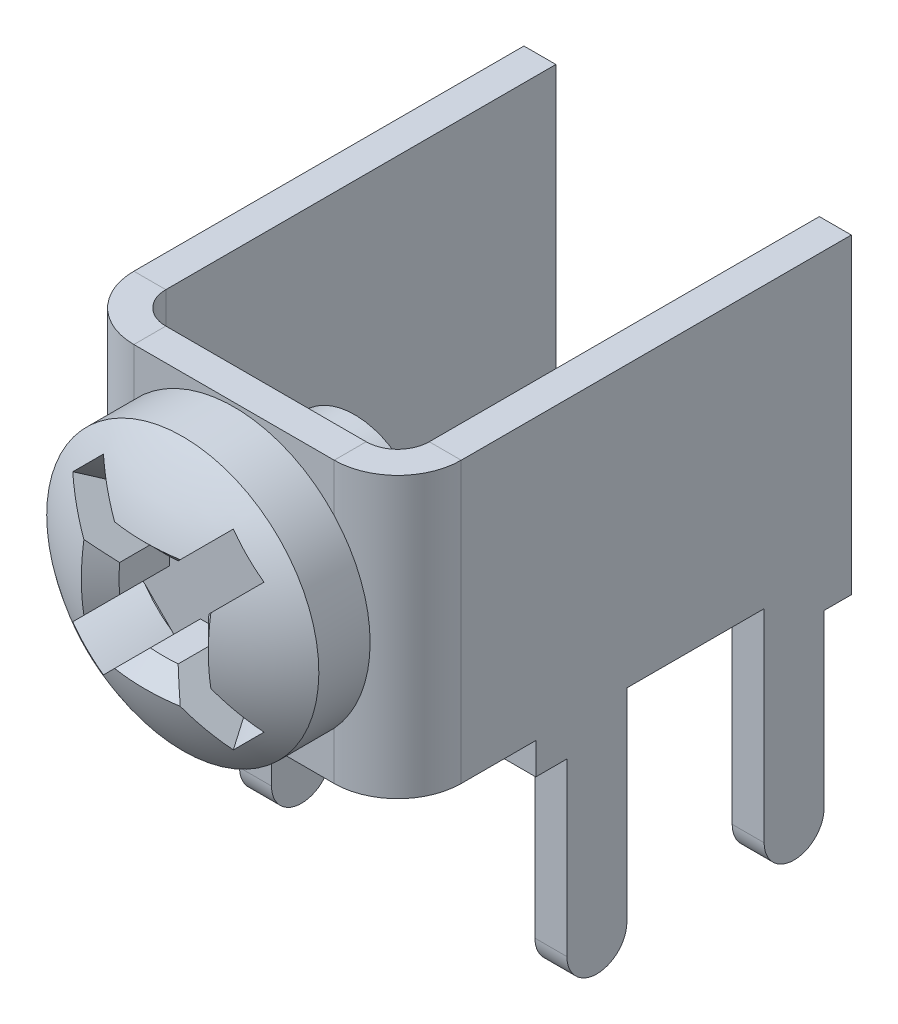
ISO-10303-21;
HEADER;
FILE_DESCRIPTION(('STEP AP214'),'2;1');
FILE_NAME('part.step','',(''),(''),'','','');
FILE_SCHEMA(('AUTOMOTIVE_DESIGN { 1 0 10303 214 1 1 1 1 }'));
ENDSEC;
DATA;
#1=APPLICATION_CONTEXT('core data for automotive mechanical design processes');
#2=APPLICATION_PROTOCOL_DEFINITION('international standard','automotive_design',2000,#1);
#3=PRODUCT_CONTEXT('',#1,'mechanical');
#4=PRODUCT('Part','Part','',(#3));
#5=PRODUCT_RELATED_PRODUCT_CATEGORY('part','',(#4));
#6=PRODUCT_DEFINITION_FORMATION('','',#4);
#7=PRODUCT_DEFINITION_CONTEXT('part definition',#1,'design');
#8=PRODUCT_DEFINITION('design','',#6,#7);
#9=PRODUCT_DEFINITION_SHAPE('','',#8);
#10=(LENGTH_UNIT() NAMED_UNIT(*) SI_UNIT(.MILLI.,.METRE.));
#11=(NAMED_UNIT(*) PLANE_ANGLE_UNIT() SI_UNIT($,.RADIAN.));
#12=(NAMED_UNIT(*) SI_UNIT($,.STERADIAN.) SOLID_ANGLE_UNIT());
#13=UNCERTAINTY_MEASURE_WITH_UNIT(LENGTH_MEASURE(1.E-05),#10,'distance_accuracy_value','');
#14=(GEOMETRIC_REPRESENTATION_CONTEXT(3) GLOBAL_UNCERTAINTY_ASSIGNED_CONTEXT((#13)) GLOBAL_UNIT_ASSIGNED_CONTEXT((#10,
#11,#12)) REPRESENTATION_CONTEXT('',''));
#15=CARTESIAN_POINT('',(0.,0.,0.));
#16=DIRECTION('',(0.,0.,1.));
#17=DIRECTION('',(1.,0.,0.));
#18=AXIS2_PLACEMENT_3D('',#15,#16,#17);
#19=CARTESIAN_POINT('',(-4.15,7.9,0.));
#20=DIRECTION('',(0.,0.,-1.));
#21=DIRECTION('',(-1.,0.,0.));
#22=AXIS2_PLACEMENT_3D('',#19,#20,#21);
#23=PLANE('',#22);
#24=DIRECTION('',(0.,-1.,0.));
#25=VECTOR('',#24,1.);
#26=CARTESIAN_POINT('',(-2.54,7.9,0.));
#27=LINE('',#26,#25);
#28=CARTESIAN_POINT('',(-2.54,7.9,0.));
#29=VERTEX_POINT('',#28);
#30=CARTESIAN_POINT('',(-2.54,6.68471625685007,0.));
#31=VERTEX_POINT('',#30);
#32=EDGE_CURVE('E429',#29,#31,#27,.T.);
#33=ORIENTED_EDGE('',*,*,#32,.T.);
#34=CARTESIAN_POINT('',(0.,4.35,0.));
#35=DIRECTION('',(0.,0.,-1.));
#36=DIRECTION('',(-1.,0.,0.));
#37=AXIS2_PLACEMENT_3D('',#34,#35,#36);
#38=CIRCLE('',#37,3.45);
#39=CARTESIAN_POINT('',(2.54,6.68471625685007,0.));
#40=VERTEX_POINT('',#39);
#41=EDGE_CURVE('E413',#31,#40,#38,.T.);
#42=ORIENTED_EDGE('',*,*,#41,.T.);
#43=DIRECTION('',(0.,-1.,0.));
#44=VECTOR('',#43,1.);
#45=CARTESIAN_POINT('',(2.54,7.9,0.));
#46=LINE('',#45,#44);
#47=CARTESIAN_POINT('',(2.54,7.9,0.));
#48=VERTEX_POINT('',#47);
#49=EDGE_CURVE('E442',#48,#40,#46,.T.);
#50=ORIENTED_EDGE('',*,*,#49,.F.);
#51=DIRECTION('',(1.,0.,0.));
#52=VECTOR('',#51,1.);
#53=CARTESIAN_POINT('',(-4.15,7.9,0.));
#54=LINE('',#53,#52);
#55=EDGE_CURVE('E437',#29,#48,#54,.T.);
#56=ORIENTED_EDGE('',*,*,#55,.F.);
#57=EDGE_LOOP('',(#33,#42,#50,#56));
#58=FACE_BOUND('',#57,.T.);
#59=ADVANCED_FACE('F34',(#58),#23,.F.);
#60=CARTESIAN_POINT('',(-4.15,7.9,-1.61));
#61=DIRECTION('',(0.,1.,0.));
#62=DIRECTION('',(0.,0.,1.));
#63=AXIS2_PLACEMENT_3D('',#60,#61,#62);
#64=PLANE('',#63);
#65=DIRECTION('',(1.,0.,0.));
#66=VECTOR('',#65,1.);
#67=CARTESIAN_POINT('',(-4.15,7.9,-1.61));
#68=LINE('',#67,#66);
#69=CARTESIAN_POINT('',(-4.15,7.9,-1.61));
#70=VERTEX_POINT('',#69);
#71=CARTESIAN_POINT('',(-3.34,7.9,-1.61));
#72=VERTEX_POINT('',#71);
#73=EDGE_CURVE('E475',#70,#72,#68,.T.);
#74=ORIENTED_EDGE('',*,*,#73,.F.);
#75=CARTESIAN_POINT('',(-2.54,7.9,-1.61));
#76=DIRECTION('',(0.,-1.,0.));
#77=DIRECTION('',(0.,0.,-1.));
#78=AXIS2_PLACEMENT_3D('',#75,#76,#77);
#79=CIRCLE('',#78,1.61);
#80=EDGE_CURVE('E984',#70,#29,#79,.F.);
#81=ORIENTED_EDGE('',*,*,#80,.T.);
#82=DIRECTION('',(0.,0.,1.));
#83=VECTOR('',#82,1.);
#84=CARTESIAN_POINT('',(-2.54,7.9,-0.81));
#85=LINE('',#84,#83);
#86=CARTESIAN_POINT('',(-2.54,7.9,-0.81));
#87=VERTEX_POINT('',#86);
#88=EDGE_CURVE('E473',#87,#29,#85,.T.);
#89=ORIENTED_EDGE('',*,*,#88,.F.);
#90=CARTESIAN_POINT('',(-2.54,7.9,-1.61));
#91=DIRECTION('',(0.,1.,0.));
#92=DIRECTION('',(1.,0.,0.));
#93=AXIS2_PLACEMENT_3D('',#90,#91,#92);
#94=CIRCLE('',#93,0.8);
#95=EDGE_CURVE('E972',#72,#87,#94,.T.);
#96=ORIENTED_EDGE('',*,*,#95,.F.);
#97=EDGE_LOOP('',(#74,#81,#89,#96));
#98=FACE_BOUND('',#97,.T.);
#99=ADVANCED_FACE('F780',(#98),#64,.T.);
#100=CARTESIAN_POINT('',(-2.54,7.9,-0.81));
#101=DIRECTION('',(0.,1.,0.));
#102=DIRECTION('',(0.,0.,1.));
#103=AXIS2_PLACEMENT_3D('',#100,#101,#102);
#104=PLANE('',#103);
#105=DIRECTION('',(0.,0.,1.));
#106=VECTOR('',#105,1.);
#107=CARTESIAN_POINT('',(-4.15,7.9,-11.5));
#108=LINE('',#107,#106);
#109=CARTESIAN_POINT('',(-4.15,7.9,-11.5));
#110=VERTEX_POINT('',#109);
#111=EDGE_CURVE('E981',#110,#70,#108,.T.);
#112=ORIENTED_EDGE('',*,*,#111,.T.);
#113=ORIENTED_EDGE('',*,*,#73,.T.);
#114=DIRECTION('',(0.,0.,1.));
#115=VECTOR('',#114,1.);
#116=CARTESIAN_POINT('',(-3.34,7.9,-11.5));
#117=LINE('',#116,#115);
#118=CARTESIAN_POINT('',(-3.34,7.9,-11.5));
#119=VERTEX_POINT('',#118);
#120=EDGE_CURVE('E975',#119,#72,#117,.T.);
#121=ORIENTED_EDGE('',*,*,#120,.F.);
#122=DIRECTION('',(1.,0.,0.));
#123=VECTOR('',#122,1.);
#124=CARTESIAN_POINT('',(-4.15,7.9,-11.5));
#125=LINE('',#124,#123);
#126=EDGE_CURVE('E978',#110,#119,#125,.T.);
#127=ORIENTED_EDGE('',*,*,#126,.F.);
#128=EDGE_LOOP('',(#112,#113,#121,#127));
#129=FACE_BOUND('',#128,.T.);
#130=ADVANCED_FACE('F786',(#129),#104,.T.);
#131=CARTESIAN_POINT('',(2.54,7.9,0.));
#132=DIRECTION('',(0.,1.,0.));
#133=DIRECTION('',(0.,0.,1.));
#134=AXIS2_PLACEMENT_3D('',#131,#132,#133);
#135=PLANE('',#134);
#136=DIRECTION('',(0.,0.,-1.));
#137=VECTOR('',#136,1.);
#138=CARTESIAN_POINT('',(2.54,7.9,0.));
#139=LINE('',#138,#137);
#140=CARTESIAN_POINT('',(2.54,7.9,-0.81));
#141=VERTEX_POINT('',#140);
#142=EDGE_CURVE('E471',#48,#141,#139,.T.);
#143=ORIENTED_EDGE('',*,*,#142,.F.);
#144=CARTESIAN_POINT('',(2.54,7.9,-1.61));
#145=DIRECTION('',(0.,-1.,0.));
#146=DIRECTION('',(0.,0.,-1.));
#147=AXIS2_PLACEMENT_3D('',#144,#145,#146);
#148=CIRCLE('',#147,1.61);
#149=CARTESIAN_POINT('',(4.15,7.9,-1.61));
#150=VERTEX_POINT('',#149);
#151=EDGE_CURVE('E988',#48,#150,#148,.F.);
#152=ORIENTED_EDGE('',*,*,#151,.T.);
#153=DIRECTION('',(1.,0.,0.));
#154=VECTOR('',#153,1.);
#155=CARTESIAN_POINT('',(3.34,7.9,-1.61));
#156=LINE('',#155,#154);
#157=CARTESIAN_POINT('',(3.34,7.9,-1.61));
#158=VERTEX_POINT('',#157);
#159=EDGE_CURVE('E469',#158,#150,#156,.T.);
#160=ORIENTED_EDGE('',*,*,#159,.F.);
#161=CARTESIAN_POINT('',(2.54,7.9,-1.61));
#162=DIRECTION('',(0.,1.,0.));
#163=DIRECTION('',(1.,0.,0.));
#164=AXIS2_PLACEMENT_3D('',#161,#162,#163);
#165=CIRCLE('',#164,0.8);
#166=EDGE_CURVE('E966',#141,#158,#165,.T.);
#167=ORIENTED_EDGE('',*,*,#166,.F.);
#168=EDGE_LOOP('',(#143,#152,#160,#167));
#169=FACE_BOUND('',#168,.T.);
#170=ADVANCED_FACE('F1064',(#169),#135,.T.);
#171=CARTESIAN_POINT('',(3.34,7.9,-1.61));
#172=DIRECTION('',(0.,1.,0.));
#173=DIRECTION('',(0.,0.,1.));
#174=AXIS2_PLACEMENT_3D('',#171,#172,#173);
#175=PLANE('',#174);
#176=ORIENTED_EDGE('',*,*,#55,.T.);
#177=ORIENTED_EDGE('',*,*,#142,.T.);
#178=DIRECTION('',(1.,0.,0.));
#179=VECTOR('',#178,1.);
#180=CARTESIAN_POINT('',(-4.15,7.9,-0.81));
#181=LINE('',#180,#179);
#182=EDGE_CURVE('E969',#87,#141,#181,.T.);
#183=ORIENTED_EDGE('',*,*,#182,.F.);
#184=ORIENTED_EDGE('',*,*,#88,.T.);
#185=EDGE_LOOP('',(#176,#177,#183,#184));
#186=FACE_BOUND('',#185,.T.);
#187=ADVANCED_FACE('F1071',(#186),#175,.T.);
#188=CARTESIAN_POINT('',(4.15,7.9,0.));
#189=DIRECTION('',(-1.,0.,0.));
#190=DIRECTION('',(0.,0.,1.));
#191=AXIS2_PLACEMENT_3D('',#188,#189,#190);
#192=PLANE('',#191);
#193=DIRECTION('',(0.,-1.,0.));
#194=VECTOR('',#193,1.);
#195=CARTESIAN_POINT('',(4.15,7.9,-1.61));
#196=LINE('',#195,#194);
#197=CARTESIAN_POINT('',(4.15,0.800000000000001,-1.61));
#198=VERTEX_POINT('',#197);
#199=EDGE_CURVE('E809',#150,#198,#196,.T.);
#200=ORIENTED_EDGE('',*,*,#199,.T.);
#201=DIRECTION('',(0.,0.,-1.));
#202=VECTOR('',#201,1.);
#203=CARTESIAN_POINT('',(4.15,0.800000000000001,0.));
#204=LINE('',#203,#202);
#205=CARTESIAN_POINT('',(4.15000000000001,0.800000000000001,-3.5));
#206=VERTEX_POINT('',#205);
#207=EDGE_CURVE('E882',#198,#206,#204,.T.);
#208=ORIENTED_EDGE('',*,*,#207,.T.);
#209=DIRECTION('',(0.,-1.,0.));
#210=VECTOR('',#209,1.);
#211=CARTESIAN_POINT('',(4.15,7.9,-3.5));
#212=LINE('',#211,#210);
#213=CARTESIAN_POINT('',(4.15000000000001,0.,-3.5));
#214=VERTEX_POINT('',#213);
#215=EDGE_CURVE('E955',#206,#214,#212,.T.);
#216=ORIENTED_EDGE('',*,*,#215,.T.);
#217=DIRECTION('',(0.,0.,-1.));
#218=VECTOR('',#217,1.);
#219=CARTESIAN_POINT('',(4.15,0.,0.));
#220=LINE('',#219,#218);
#221=CARTESIAN_POINT('',(4.15000000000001,0.,-4.29));
#222=VERTEX_POINT('',#221);
#223=EDGE_CURVE('E948',#214,#222,#220,.T.);
#224=ORIENTED_EDGE('',*,*,#223,.T.);
#225=DIRECTION('',(0.,-1.,0.));
#226=VECTOR('',#225,1.);
#227=CARTESIAN_POINT('',(4.15,7.9,-4.29));
#228=LINE('',#227,#226);
#229=CARTESIAN_POINT('',(4.15000000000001,-4.34,-4.29));
#230=VERTEX_POINT('',#229);
#231=EDGE_CURVE('E941',#222,#230,#228,.T.);
#232=ORIENTED_EDGE('',*,*,#231,.T.);
#233=CARTESIAN_POINT('',(4.15,-4.34,-5.05));
#234=DIRECTION('',(-1.,0.,0.));
#235=DIRECTION('',(0.,0.,1.));
#236=AXIS2_PLACEMENT_3D('',#233,#234,#235);
#237=CIRCLE('',#236,0.76);
#238=CARTESIAN_POINT('',(4.15000000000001,-4.34,-5.81));
#239=VERTEX_POINT('',#238);
#240=EDGE_CURVE('E880',#230,#239,#237,.F.);
#241=ORIENTED_EDGE('',*,*,#240,.T.);
#242=DIRECTION('',(0.,1.,0.));
#243=VECTOR('',#242,1.);
#244=CARTESIAN_POINT('',(4.15,7.9,-5.81));
#245=LINE('',#244,#243);
#246=CARTESIAN_POINT('',(4.15000000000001,0.800000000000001,-5.81));
#247=VERTEX_POINT('',#246);
#248=EDGE_CURVE('E933',#239,#247,#245,.T.);
#249=ORIENTED_EDGE('',*,*,#248,.T.);
#250=DIRECTION('',(0.,0.,-1.));
#251=VECTOR('',#250,1.);
#252=CARTESIAN_POINT('',(4.15,0.800000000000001,0.));
#253=LINE('',#252,#251);
#254=CARTESIAN_POINT('',(4.15000000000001,0.800000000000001,-9.29));
#255=VERTEX_POINT('',#254);
#256=EDGE_CURVE('E926',#247,#255,#253,.T.);
#257=ORIENTED_EDGE('',*,*,#256,.T.);
#258=DIRECTION('',(0.,-1.,0.));
#259=VECTOR('',#258,1.);
#260=CARTESIAN_POINT('',(4.15,7.9,-9.29));
#261=LINE('',#260,#259);
#262=CARTESIAN_POINT('',(4.15000000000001,-4.34,-9.29));
#263=VERTEX_POINT('',#262);
#264=EDGE_CURVE('E919',#255,#263,#261,.T.);
#265=ORIENTED_EDGE('',*,*,#264,.T.);
#266=CARTESIAN_POINT('',(4.15,-4.34,-10.05));
#267=DIRECTION('',(-1.,0.,0.));
#268=DIRECTION('',(0.,0.,1.));
#269=AXIS2_PLACEMENT_3D('',#266,#267,#268);
#270=CIRCLE('',#269,0.759999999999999);
#271=CARTESIAN_POINT('',(4.15000000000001,-4.34,-10.81));
#272=VERTEX_POINT('',#271);
#273=EDGE_CURVE('E872',#263,#272,#270,.F.);
#274=ORIENTED_EDGE('',*,*,#273,.T.);
#275=DIRECTION('',(0.,1.,0.));
#276=VECTOR('',#275,1.);
#277=CARTESIAN_POINT('',(4.15,7.9,-10.81));
#278=LINE('',#277,#276);
#279=CARTESIAN_POINT('',(4.15000000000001,0.,-10.81));
#280=VERTEX_POINT('',#279);
#281=EDGE_CURVE('E911',#272,#280,#278,.T.);
#282=ORIENTED_EDGE('',*,*,#281,.T.);
#283=DIRECTION('',(0.,0.,-1.));
#284=VECTOR('',#283,1.);
#285=CARTESIAN_POINT('',(4.15,0.,0.));
#286=LINE('',#285,#284);
#287=CARTESIAN_POINT('',(4.15000000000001,0.,-11.5));
#288=VERTEX_POINT('',#287);
#289=EDGE_CURVE('E904',#280,#288,#286,.T.);
#290=ORIENTED_EDGE('',*,*,#289,.T.);
#291=DIRECTION('',(0.,-1.,0.));
#292=VECTOR('',#291,1.);
#293=CARTESIAN_POINT('',(4.15,7.9,-11.5));
#294=LINE('',#293,#292);
#295=CARTESIAN_POINT('',(4.15,7.9,-11.5));
#296=VERTEX_POINT('',#295);
#297=EDGE_CURVE('E466',#296,#288,#294,.T.);
#298=ORIENTED_EDGE('',*,*,#297,.F.);
#299=DIRECTION('',(0.,0.,-1.));
#300=VECTOR('',#299,1.);
#301=CARTESIAN_POINT('',(4.15,7.9,0.));
#302=LINE('',#301,#300);
#303=EDGE_CURVE('E958',#150,#296,#302,.T.);
#304=ORIENTED_EDGE('',*,*,#303,.F.);
#305=EDGE_LOOP('',(#200,#208,#216,#224,#232,#241,#249,#257,#265,#274,#282,#290,#298,#304));
#306=FACE_BOUND('',#305,.T.);
#307=ADVANCED_FACE('F994',(#306),#192,.F.);
#308=CARTESIAN_POINT('',(3.34,7.9,-11.5));
#309=DIRECTION('',(0.,0.,-1.));
#310=DIRECTION('',(-1.,0.,0.));
#311=AXIS2_PLACEMENT_3D('',#308,#309,#310);
#312=PLANE('',#311);
#313=DIRECTION('',(-1.,0.,0.));
#314=VECTOR('',#313,1.);
#315=CARTESIAN_POINT('',(29.2362785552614,0.,-11.5));
#316=LINE('',#315,#314);
#317=CARTESIAN_POINT('',(3.34000000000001,0.,-11.5));
#318=VERTEX_POINT('',#317);
#319=EDGE_CURVE('E825',#288,#318,#316,.T.);
#320=ORIENTED_EDGE('',*,*,#319,.T.);
#321=DIRECTION('',(0.,-1.,0.));
#322=VECTOR('',#321,1.);
#323=CARTESIAN_POINT('',(3.34,7.9,-11.5));
#324=LINE('',#323,#322);
#325=CARTESIAN_POINT('',(3.34,7.9,-11.5));
#326=VERTEX_POINT('',#325);
#327=EDGE_CURVE('E463',#326,#318,#324,.T.);
#328=ORIENTED_EDGE('',*,*,#327,.F.);
#329=DIRECTION('',(1.,0.,0.));
#330=VECTOR('',#329,1.);
#331=CARTESIAN_POINT('',(3.34,7.9,-11.5));
#332=LINE('',#331,#330);
#333=EDGE_CURVE('E960',#326,#296,#332,.T.);
#334=ORIENTED_EDGE('',*,*,#333,.T.);
#335=ORIENTED_EDGE('',*,*,#297,.T.);
#336=EDGE_LOOP('',(#320,#328,#334,#335));
#337=FACE_BOUND('',#336,.T.);
#338=ADVANCED_FACE('F1054',(#337),#312,.T.);
#339=CARTESIAN_POINT('',(3.34,7.9,0.));
#340=DIRECTION('',(-1.,0.,0.));
#341=DIRECTION('',(0.,0.,1.));
#342=AXIS2_PLACEMENT_3D('',#339,#340,#341);
#343=PLANE('',#342);
#344=DIRECTION('',(0.,0.,-1.));
#345=VECTOR('',#344,1.);
#346=CARTESIAN_POINT('',(3.34,0.800000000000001,0.));
#347=LINE('',#346,#345);
#348=CARTESIAN_POINT('',(3.34,0.800000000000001,-1.61));
#349=VERTEX_POINT('',#348);
#350=CARTESIAN_POINT('',(3.34000000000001,0.800000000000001,-3.5));
#351=VERTEX_POINT('',#350);
#352=EDGE_CURVE('E898',#349,#351,#347,.T.);
#353=ORIENTED_EDGE('',*,*,#352,.F.);
#354=DIRECTION('',(0.,-1.,0.));
#355=VECTOR('',#354,1.);
#356=CARTESIAN_POINT('',(3.34,7.9,-1.61));
#357=LINE('',#356,#355);
#358=EDGE_CURVE('E460',#158,#349,#357,.T.);
#359=ORIENTED_EDGE('',*,*,#358,.F.);
#360=DIRECTION('',(0.,0.,-1.));
#361=VECTOR('',#360,1.);
#362=CARTESIAN_POINT('',(3.34,7.9,0.));
#363=LINE('',#362,#361);
#364=EDGE_CURVE('E963',#158,#326,#363,.T.);
#365=ORIENTED_EDGE('',*,*,#364,.T.);
#366=ORIENTED_EDGE('',*,*,#327,.T.);
#367=DIRECTION('',(0.,0.,-1.));
#368=VECTOR('',#367,1.);
#369=CARTESIAN_POINT('',(3.34,0.,0.));
#370=LINE('',#369,#368);
#371=CARTESIAN_POINT('',(3.34000000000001,0.,-10.81));
#372=VERTEX_POINT('',#371);
#373=EDGE_CURVE('E902',#372,#318,#370,.T.);
#374=ORIENTED_EDGE('',*,*,#373,.F.);
#375=DIRECTION('',(0.,1.,0.));
#376=VECTOR('',#375,1.);
#377=CARTESIAN_POINT('',(3.34,7.9,-10.81));
#378=LINE('',#377,#376);
#379=CARTESIAN_POINT('',(3.34000000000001,-4.34,-10.81));
#380=VERTEX_POINT('',#379);
#381=EDGE_CURVE('E909',#380,#372,#378,.T.);
#382=ORIENTED_EDGE('',*,*,#381,.F.);
#383=CARTESIAN_POINT('',(3.34,-4.34,-10.05));
#384=DIRECTION('',(-1.,0.,0.));
#385=DIRECTION('',(0.,0.,1.));
#386=AXIS2_PLACEMENT_3D('',#383,#384,#385);
#387=CIRCLE('',#386,0.759999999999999);
#388=CARTESIAN_POINT('',(3.34000000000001,-4.34,-9.29));
#389=VERTEX_POINT('',#388);
#390=EDGE_CURVE('E870',#389,#380,#387,.F.);
#391=ORIENTED_EDGE('',*,*,#390,.F.);
#392=DIRECTION('',(0.,-1.,0.));
#393=VECTOR('',#392,1.);
#394=CARTESIAN_POINT('',(3.34,7.9,-9.29));
#395=LINE('',#394,#393);
#396=CARTESIAN_POINT('',(3.34000000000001,0.800000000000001,-9.29));
#397=VERTEX_POINT('',#396);
#398=EDGE_CURVE('E916',#397,#389,#395,.T.);
#399=ORIENTED_EDGE('',*,*,#398,.F.);
#400=DIRECTION('',(0.,0.,-1.));
#401=VECTOR('',#400,1.);
#402=CARTESIAN_POINT('',(3.34,0.800000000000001,0.));
#403=LINE('',#402,#401);
#404=CARTESIAN_POINT('',(3.34000000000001,0.800000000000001,-5.81));
#405=VERTEX_POINT('',#404);
#406=EDGE_CURVE('E924',#405,#397,#403,.T.);
#407=ORIENTED_EDGE('',*,*,#406,.F.);
#408=DIRECTION('',(0.,1.,0.));
#409=VECTOR('',#408,1.);
#410=CARTESIAN_POINT('',(3.34,7.9,-5.81));
#411=LINE('',#410,#409);
#412=CARTESIAN_POINT('',(3.34000000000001,-4.34,-5.81));
#413=VERTEX_POINT('',#412);
#414=EDGE_CURVE('E931',#413,#405,#411,.T.);
#415=ORIENTED_EDGE('',*,*,#414,.F.);
#416=CARTESIAN_POINT('',(3.34,-4.34,-5.05));
#417=DIRECTION('',(-1.,0.,0.));
#418=DIRECTION('',(0.,0.,1.));
#419=AXIS2_PLACEMENT_3D('',#416,#417,#418);
#420=CIRCLE('',#419,0.76);
#421=CARTESIAN_POINT('',(3.34000000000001,-4.34,-4.29));
#422=VERTEX_POINT('',#421);
#423=EDGE_CURVE('E878',#422,#413,#420,.F.);
#424=ORIENTED_EDGE('',*,*,#423,.F.);
#425=DIRECTION('',(0.,-1.,0.));
#426=VECTOR('',#425,1.);
#427=CARTESIAN_POINT('',(3.34,7.9,-4.29));
#428=LINE('',#427,#426);
#429=CARTESIAN_POINT('',(3.34000000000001,0.,-4.29));
#430=VERTEX_POINT('',#429);
#431=EDGE_CURVE('E938',#430,#422,#428,.T.);
#432=ORIENTED_EDGE('',*,*,#431,.F.);
#433=DIRECTION('',(0.,0.,-1.));
#434=VECTOR('',#433,1.);
#435=CARTESIAN_POINT('',(3.34,0.,0.));
#436=LINE('',#435,#434);
#437=CARTESIAN_POINT('',(3.34000000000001,0.,-3.5));
#438=VERTEX_POINT('',#437);
#439=EDGE_CURVE('E946',#438,#430,#436,.T.);
#440=ORIENTED_EDGE('',*,*,#439,.F.);
#441=DIRECTION('',(0.,-1.,0.));
#442=VECTOR('',#441,1.);
#443=CARTESIAN_POINT('',(3.34,7.9,-3.5));
#444=LINE('',#443,#442);
#445=EDGE_CURVE('E953',#351,#438,#444,.T.);
#446=ORIENTED_EDGE('',*,*,#445,.F.);
#447=EDGE_LOOP('',(#353,#359,#365,#366,#374,#382,#391,#399,#407,#415,#424,#432,#440,#446));
#448=FACE_BOUND('',#447,.T.);
#449=ADVANCED_FACE('F1008',(#448),#343,.T.);
#450=CARTESIAN_POINT('',(2.54,7.9,-1.61));
#451=DIRECTION('',(0.,-1.,0.));
#452=DIRECTION('',(0.,0.,-1.));
#453=AXIS2_PLACEMENT_3D('',#450,#451,#452);
#454=CYLINDRICAL_SURFACE('',#453,0.8);
#455=CARTESIAN_POINT('',(2.54,0.800000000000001,-1.61));
#456=DIRECTION('',(0.,1.,0.));
#457=DIRECTION('',(0.,0.,1.));
#458=AXIS2_PLACEMENT_3D('',#455,#456,#457);
#459=CIRCLE('',#458,0.8);
#460=CARTESIAN_POINT('',(2.54,0.800000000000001,-0.81));
#461=VERTEX_POINT('',#460);
#462=EDGE_CURVE('E896',#461,#349,#459,.T.);
#463=ORIENTED_EDGE('',*,*,#462,.F.);
#464=DIRECTION('',(0.,-1.,0.));
#465=VECTOR('',#464,1.);
#466=CARTESIAN_POINT('',(2.54,7.9,-0.81));
#467=LINE('',#466,#465);
#468=EDGE_CURVE('E457',#141,#461,#467,.T.);
#469=ORIENTED_EDGE('',*,*,#468,.F.);
#470=ORIENTED_EDGE('',*,*,#166,.T.);
#471=ORIENTED_EDGE('',*,*,#358,.T.);
#472=EDGE_LOOP('',(#463,#469,#470,#471));
#473=FACE_BOUND('',#472,.T.);
#474=ADVANCED_FACE('F1060',(#473),#454,.F.);
#475=CARTESIAN_POINT('',(-4.15,7.9,-0.81));
#476=DIRECTION('',(0.,0.,-1.));
#477=DIRECTION('',(-1.,0.,0.));
#478=AXIS2_PLACEMENT_3D('',#475,#476,#477);
#479=PLANE('',#478);
#480=CARTESIAN_POINT('',(0.,4.35,-0.81));
#481=DIRECTION('',(0.,0.,-1.));
#482=DIRECTION('',(-1.,0.,0.));
#483=AXIS2_PLACEMENT_3D('',#480,#481,#482);
#484=CIRCLE('',#483,1.75);
#485=CARTESIAN_POINT('',(-1.75,4.35,-0.81));
#486=VERTEX_POINT('',#485);
#487=EDGE_CURVE('E504',#486,#486,#484,.T.);
#488=ORIENTED_EDGE('',*,*,#487,.F.);
#489=EDGE_LOOP('',(#488));
#490=FACE_BOUND('',#489,.T.);
#491=DIRECTION('',(1.,0.,0.));
#492=VECTOR('',#491,1.);
#493=CARTESIAN_POINT('',(-4.15,0.800000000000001,-0.81));
#494=LINE('',#493,#492);
#495=CARTESIAN_POINT('',(-2.54,0.800000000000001,-0.81));
#496=VERTEX_POINT('',#495);
#497=EDGE_CURVE('E894',#496,#461,#494,.T.);
#498=ORIENTED_EDGE('',*,*,#497,.F.);
#499=DIRECTION('',(0.,-1.,0.));
#500=VECTOR('',#499,1.);
#501=CARTESIAN_POINT('',(-2.54,7.9,-0.81));
#502=LINE('',#501,#500);
#503=EDGE_CURVE('E454',#87,#496,#502,.T.);
#504=ORIENTED_EDGE('',*,*,#503,.F.);
#505=ORIENTED_EDGE('',*,*,#182,.T.);
#506=ORIENTED_EDGE('',*,*,#468,.T.);
#507=EDGE_LOOP('',(#498,#504,#505,#506));
#508=FACE_BOUND('',#507,.T.);
#509=ADVANCED_FACE('F1069',(#490,#508),#479,.T.);
#510=CARTESIAN_POINT('',(-2.54,7.9,-1.61));
#511=DIRECTION('',(0.,-1.,0.));
#512=DIRECTION('',(0.,0.,-1.));
#513=AXIS2_PLACEMENT_3D('',#510,#511,#512);
#514=CYLINDRICAL_SURFACE('',#513,0.8);
#515=CARTESIAN_POINT('',(-2.54,0.800000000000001,-1.61));
#516=DIRECTION('',(0.,1.,0.));
#517=DIRECTION('',(0.,0.,1.));
#518=AXIS2_PLACEMENT_3D('',#515,#516,#517);
#519=CIRCLE('',#518,0.8);
#520=CARTESIAN_POINT('',(-3.34,0.800000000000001,-1.61));
#521=VERTEX_POINT('',#520);
#522=EDGE_CURVE('E892',#521,#496,#519,.T.);
#523=ORIENTED_EDGE('',*,*,#522,.F.);
#524=DIRECTION('',(0.,-1.,0.));
#525=VECTOR('',#524,1.);
#526=CARTESIAN_POINT('',(-3.34,7.9,-1.61));
#527=LINE('',#526,#525);
#528=EDGE_CURVE('E451',#72,#521,#527,.T.);
#529=ORIENTED_EDGE('',*,*,#528,.F.);
#530=ORIENTED_EDGE('',*,*,#95,.T.);
#531=ORIENTED_EDGE('',*,*,#503,.T.);
#532=EDGE_LOOP('',(#523,#529,#530,#531));
#533=FACE_BOUND('',#532,.T.);
#534=ADVANCED_FACE('F1076',(#533),#514,.F.);
#535=CARTESIAN_POINT('',(-3.34,7.9,-11.5));
#536=DIRECTION('',(1.,0.,0.));
#537=DIRECTION('',(0.,0.,-1.));
#538=AXIS2_PLACEMENT_3D('',#535,#536,#537);
#539=PLANE('',#538);
#540=DIRECTION('',(0.,0.,1.));
#541=VECTOR('',#540,1.);
#542=CARTESIAN_POINT('',(-3.34,0.800000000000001,-11.5));
#543=LINE('',#542,#541);
#544=CARTESIAN_POINT('',(-3.33999999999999,0.800000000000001,-3.5));
#545=VERTEX_POINT('',#544);
#546=EDGE_CURVE('E890',#545,#521,#543,.T.);
#547=ORIENTED_EDGE('',*,*,#546,.F.);
#548=DIRECTION('',(0.,1.,0.));
#549=VECTOR('',#548,1.);
#550=CARTESIAN_POINT('',(-3.34,7.9,-3.5));
#551=LINE('',#550,#549);
#552=CARTESIAN_POINT('',(-3.33999999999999,0.,-3.5));
#553=VERTEX_POINT('',#552);
#554=EDGE_CURVE('E951',#553,#545,#551,.T.);
#555=ORIENTED_EDGE('',*,*,#554,.F.);
#556=DIRECTION('',(0.,0.,1.));
#557=VECTOR('',#556,1.);
#558=CARTESIAN_POINT('',(-3.34,0.,-11.5));
#559=LINE('',#558,#557);
#560=CARTESIAN_POINT('',(-3.33999999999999,0.,-4.29));
#561=VERTEX_POINT('',#560);
#562=EDGE_CURVE('E944',#561,#553,#559,.T.);
#563=ORIENTED_EDGE('',*,*,#562,.F.);
#564=DIRECTION('',(0.,1.,0.));
#565=VECTOR('',#564,1.);
#566=CARTESIAN_POINT('',(-3.34,7.9,-4.29));
#567=LINE('',#566,#565);
#568=CARTESIAN_POINT('',(-3.33999999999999,-4.34,-4.29));
#569=VERTEX_POINT('',#568);
#570=EDGE_CURVE('E936',#569,#561,#567,.T.);
#571=ORIENTED_EDGE('',*,*,#570,.F.);
#572=CARTESIAN_POINT('',(-3.34,-4.34,-5.05));
#573=DIRECTION('',(1.,0.,0.));
#574=DIRECTION('',(0.,0.,-1.));
#575=AXIS2_PLACEMENT_3D('',#572,#573,#574);
#576=CIRCLE('',#575,0.76);
#577=CARTESIAN_POINT('',(-3.33999999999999,-4.34,-5.81));
#578=VERTEX_POINT('',#577);
#579=EDGE_CURVE('E876',#578,#569,#576,.F.);
#580=ORIENTED_EDGE('',*,*,#579,.F.);
#581=DIRECTION('',(0.,-1.,0.));
#582=VECTOR('',#581,1.);
#583=CARTESIAN_POINT('',(-3.34,7.9,-5.81));
#584=LINE('',#583,#582);
#585=CARTESIAN_POINT('',(-3.33999999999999,0.800000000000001,-5.81));
#586=VERTEX_POINT('',#585);
#587=EDGE_CURVE('E929',#586,#578,#584,.T.);
#588=ORIENTED_EDGE('',*,*,#587,.F.);
#589=DIRECTION('',(0.,0.,1.));
#590=VECTOR('',#589,1.);
#591=CARTESIAN_POINT('',(-3.34,0.800000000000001,-11.5));
#592=LINE('',#591,#590);
#593=CARTESIAN_POINT('',(-3.33999999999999,0.800000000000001,-9.29));
#594=VERTEX_POINT('',#593);
#595=EDGE_CURVE('E922',#594,#586,#592,.T.);
#596=ORIENTED_EDGE('',*,*,#595,.F.);
#597=DIRECTION('',(0.,1.,0.));
#598=VECTOR('',#597,1.);
#599=CARTESIAN_POINT('',(-3.34,7.9,-9.29));
#600=LINE('',#599,#598);
#601=CARTESIAN_POINT('',(-3.33999999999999,-4.34,-9.29));
#602=VERTEX_POINT('',#601);
#603=EDGE_CURVE('E914',#602,#594,#600,.T.);
#604=ORIENTED_EDGE('',*,*,#603,.F.);
#605=CARTESIAN_POINT('',(-3.34,-4.34,-10.05));
#606=DIRECTION('',(1.,0.,0.));
#607=DIRECTION('',(0.,0.,-1.));
#608=AXIS2_PLACEMENT_3D('',#605,#606,#607);
#609=CIRCLE('',#608,0.759999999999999);
#610=CARTESIAN_POINT('',(-3.33999999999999,-4.34,-10.81));
#611=VERTEX_POINT('',#610);
#612=EDGE_CURVE('E868',#611,#602,#609,.F.);
#613=ORIENTED_EDGE('',*,*,#612,.F.);
#614=DIRECTION('',(0.,-1.,0.));
#615=VECTOR('',#614,1.);
#616=CARTESIAN_POINT('',(-3.34,7.9,-10.81));
#617=LINE('',#616,#615);
#618=CARTESIAN_POINT('',(-3.33999999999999,0.,-10.81));
#619=VERTEX_POINT('',#618);
#620=EDGE_CURVE('E907',#619,#611,#617,.T.);
#621=ORIENTED_EDGE('',*,*,#620,.F.);
#622=DIRECTION('',(0.,0.,1.));
#623=VECTOR('',#622,1.);
#624=CARTESIAN_POINT('',(-3.34,0.,-11.5));
#625=LINE('',#624,#623);
#626=CARTESIAN_POINT('',(-3.33999999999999,0.,-11.5));
#627=VERTEX_POINT('',#626);
#628=EDGE_CURVE('E900',#627,#619,#625,.T.);
#629=ORIENTED_EDGE('',*,*,#628,.F.);
#630=DIRECTION('',(0.,-1.,0.));
#631=VECTOR('',#630,1.);
#632=CARTESIAN_POINT('',(-3.34,7.9,-11.5));
#633=LINE('',#632,#631);
#634=EDGE_CURVE('E448',#119,#627,#633,.T.);
#635=ORIENTED_EDGE('',*,*,#634,.F.);
#636=ORIENTED_EDGE('',*,*,#120,.T.);
#637=ORIENTED_EDGE('',*,*,#528,.T.);
#638=EDGE_LOOP('',(#547,#555,#563,#571,#580,#588,#596,#604,#613,#621,#629,#635,#636,#637));
#639=FACE_BOUND('',#638,.T.);
#640=ADVANCED_FACE('F1080',(#639),#539,.T.);
#641=CARTESIAN_POINT('',(-4.15,7.9,-11.5));
#642=DIRECTION('',(0.,0.,-1.));
#643=DIRECTION('',(-1.,0.,0.));
#644=AXIS2_PLACEMENT_3D('',#641,#642,#643);
#645=PLANE('',#644);
#646=CARTESIAN_POINT('',(-4.14999999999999,0.,-11.5));
#647=VERTEX_POINT('',#646);
#648=EDGE_CURVE('E822',#627,#647,#316,.T.);
#649=ORIENTED_EDGE('',*,*,#648,.T.);
#650=DIRECTION('',(0.,-1.,0.));
#651=VECTOR('',#650,1.);
#652=CARTESIAN_POINT('',(-4.15,7.9,-11.5));
#653=LINE('',#652,#651);
#654=EDGE_CURVE('E440',#110,#647,#653,.T.);
#655=ORIENTED_EDGE('',*,*,#654,.F.);
#656=ORIENTED_EDGE('',*,*,#126,.T.);
#657=ORIENTED_EDGE('',*,*,#634,.T.);
#658=EDGE_LOOP('',(#649,#655,#656,#657));
#659=FACE_BOUND('',#658,.T.);
#660=ADVANCED_FACE('F1085',(#659),#645,.T.);
#661=CARTESIAN_POINT('',(-4.15,7.9,-11.5));
#662=DIRECTION('',(1.,0.,0.));
#663=DIRECTION('',(0.,0.,-1.));
#664=AXIS2_PLACEMENT_3D('',#661,#662,#663);
#665=PLANE('',#664);
#666=DIRECTION('',(0.,1.,0.));
#667=VECTOR('',#666,1.);
#668=CARTESIAN_POINT('',(-4.15,7.9,-3.5));
#669=LINE('',#668,#667);
#670=CARTESIAN_POINT('',(-4.14999999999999,0.,-3.5));
#671=VERTEX_POINT('',#670);
#672=CARTESIAN_POINT('',(-4.14999999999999,0.800000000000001,-3.5));
#673=VERTEX_POINT('',#672);
#674=EDGE_CURVE('E501',#671,#673,#669,.T.);
#675=ORIENTED_EDGE('',*,*,#674,.T.);
#676=DIRECTION('',(0.,0.,1.));
#677=VECTOR('',#676,1.);
#678=CARTESIAN_POINT('',(-4.15,0.800000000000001,-11.5));
#679=LINE('',#678,#677);
#680=CARTESIAN_POINT('',(-4.15,0.800000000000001,-1.61));
#681=VERTEX_POINT('',#680);
#682=EDGE_CURVE('E887',#673,#681,#679,.T.);
#683=ORIENTED_EDGE('',*,*,#682,.T.);
#684=DIRECTION('',(0.,-1.,0.));
#685=VECTOR('',#684,1.);
#686=CARTESIAN_POINT('',(-4.15,7.9,-1.61));
#687=LINE('',#686,#685);
#688=EDGE_CURVE('E438',#70,#681,#687,.T.);
#689=ORIENTED_EDGE('',*,*,#688,.F.);
#690=ORIENTED_EDGE('',*,*,#111,.F.);
#691=ORIENTED_EDGE('',*,*,#654,.T.);
#692=DIRECTION('',(0.,0.,1.));
#693=VECTOR('',#692,1.);
#694=CARTESIAN_POINT('',(-4.15,0.,-11.5));
#695=LINE('',#694,#693);
#696=CARTESIAN_POINT('',(-4.14999999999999,0.,-10.81));
#697=VERTEX_POINT('',#696);
#698=EDGE_CURVE('E480',#647,#697,#695,.T.);
#699=ORIENTED_EDGE('',*,*,#698,.T.);
#700=DIRECTION('',(0.,-1.,0.));
#701=VECTOR('',#700,1.);
#702=CARTESIAN_POINT('',(-4.15,7.9,-10.81));
#703=LINE('',#702,#701);
#704=CARTESIAN_POINT('',(-4.14999999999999,-4.34,-10.81));
#705=VERTEX_POINT('',#704);
#706=EDGE_CURVE('E483',#697,#705,#703,.T.);
#707=ORIENTED_EDGE('',*,*,#706,.T.);
#708=CARTESIAN_POINT('',(-4.15,-4.34,-10.05));
#709=DIRECTION('',(1.,0.,0.));
#710=DIRECTION('',(0.,0.,-1.));
#711=AXIS2_PLACEMENT_3D('',#708,#709,#710);
#712=CIRCLE('',#711,0.759999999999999);
#713=CARTESIAN_POINT('',(-4.14999999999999,-4.34,-9.29));
#714=VERTEX_POINT('',#713);
#715=EDGE_CURVE('E866',#705,#714,#712,.F.);
#716=ORIENTED_EDGE('',*,*,#715,.T.);
#717=DIRECTION('',(0.,1.,0.));
#718=VECTOR('',#717,1.);
#719=CARTESIAN_POINT('',(-4.15,7.9,-9.29));
#720=LINE('',#719,#718);
#721=CARTESIAN_POINT('',(-4.14999999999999,0.800000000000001,-9.29));
#722=VERTEX_POINT('',#721);
#723=EDGE_CURVE('E486',#714,#722,#720,.T.);
#724=ORIENTED_EDGE('',*,*,#723,.T.);
#725=DIRECTION('',(0.,0.,1.));
#726=VECTOR('',#725,1.);
#727=CARTESIAN_POINT('',(-4.15,0.800000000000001,-11.5));
#728=LINE('',#727,#726);
#729=CARTESIAN_POINT('',(-4.14999999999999,0.800000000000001,-5.81));
#730=VERTEX_POINT('',#729);
#731=EDGE_CURVE('E489',#722,#730,#728,.T.);
#732=ORIENTED_EDGE('',*,*,#731,.T.);
#733=DIRECTION('',(0.,-1.,0.));
#734=VECTOR('',#733,1.);
#735=CARTESIAN_POINT('',(-4.15,7.9,-5.81));
#736=LINE('',#735,#734);
#737=CARTESIAN_POINT('',(-4.14999999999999,-4.34,-5.81));
#738=VERTEX_POINT('',#737);
#739=EDGE_CURVE('E492',#730,#738,#736,.T.);
#740=ORIENTED_EDGE('',*,*,#739,.T.);
#741=CARTESIAN_POINT('',(-4.15,-4.34,-5.05));
#742=DIRECTION('',(1.,0.,0.));
#743=DIRECTION('',(0.,0.,-1.));
#744=AXIS2_PLACEMENT_3D('',#741,#742,#743);
#745=CIRCLE('',#744,0.76);
#746=CARTESIAN_POINT('',(-4.14999999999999,-4.34,-4.29));
#747=VERTEX_POINT('',#746);
#748=EDGE_CURVE('E874',#738,#747,#745,.F.);
#749=ORIENTED_EDGE('',*,*,#748,.T.);
#750=DIRECTION('',(0.,1.,0.));
#751=VECTOR('',#750,1.);
#752=CARTESIAN_POINT('',(-4.15,7.9,-4.29));
#753=LINE('',#752,#751);
#754=CARTESIAN_POINT('',(-4.14999999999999,0.,-4.29));
#755=VERTEX_POINT('',#754);
#756=EDGE_CURVE('E495',#747,#755,#753,.T.);
#757=ORIENTED_EDGE('',*,*,#756,.T.);
#758=DIRECTION('',(0.,0.,1.));
#759=VECTOR('',#758,1.);
#760=CARTESIAN_POINT('',(-4.15,0.,-11.5));
#761=LINE('',#760,#759);
#762=EDGE_CURVE('E498',#755,#671,#761,.T.);
#763=ORIENTED_EDGE('',*,*,#762,.T.);
#764=EDGE_LOOP('',(#675,#683,#689,#690,#691,#699,#707,#716,#724,#732,#740,#749,#757,#763));
#765=FACE_BOUND('',#764,.T.);
#766=ADVANCED_FACE('F800',(#765),#665,.F.);
#767=CARTESIAN_POINT('',(-2.54,7.9,-1.61));
#768=DIRECTION('',(0.,-1.,0.));
#769=DIRECTION('',(0.,0.,-1.));
#770=AXIS2_PLACEMENT_3D('',#767,#768,#769);
#771=CYLINDRICAL_SURFACE('',#770,1.61);
#772=ORIENTED_EDGE('',*,*,#688,.T.);
#773=CARTESIAN_POINT('',(-2.54,0.800000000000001,-1.61));
#774=DIRECTION('',(0.,1.,0.));
#775=DIRECTION('',(0.,0.,1.));
#776=AXIS2_PLACEMENT_3D('',#773,#774,#775);
#777=CIRCLE('',#776,1.61);
#778=CARTESIAN_POINT('',(-2.53999999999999,0.800000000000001,0.));
#779=VERTEX_POINT('',#778);
#780=EDGE_CURVE('E885',#681,#779,#777,.T.);
#781=ORIENTED_EDGE('',*,*,#780,.T.);
#782=CARTESIAN_POINT('',(-2.54,2.01528374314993,0.));
#783=VERTEX_POINT('',#782);
#784=EDGE_CURVE('E432',#783,#779,#27,.T.);
#785=ORIENTED_EDGE('',*,*,#784,.F.);
#786=DIRECTION('',(0.,-1.,0.));
#787=VECTOR('',#786,1.);
#788=CARTESIAN_POINT('',(-2.54,7.9,0.));
#789=LINE('',#788,#787);
#790=EDGE_CURVE('E406',#31,#783,#789,.T.);
#791=ORIENTED_EDGE('',*,*,#790,.F.);
#792=ORIENTED_EDGE('',*,*,#32,.F.);
#793=ORIENTED_EDGE('',*,*,#80,.F.);
#794=EDGE_LOOP('',(#772,#781,#785,#791,#792,#793));
#795=FACE_BOUND('',#794,.T.);
#796=ADVANCED_FACE('F427',(#795),#771,.T.);
#797=CARTESIAN_POINT('',(2.54,2.01528374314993,0.));
#798=VERTEX_POINT('',#797);
#799=CARTESIAN_POINT('',(2.54,0.800000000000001,0.));
#800=VERTEX_POINT('',#799);
#801=EDGE_CURVE('E803',#798,#800,#46,.T.);
#802=ORIENTED_EDGE('',*,*,#801,.F.);
#803=EDGE_CURVE('E410',#798,#783,#38,.T.);
#804=ORIENTED_EDGE('',*,*,#803,.T.);
#805=ORIENTED_EDGE('',*,*,#784,.T.);
#806=DIRECTION('',(-1.,0.,0.));
#807=VECTOR('',#806,1.);
#808=CARTESIAN_POINT('',(29.2362785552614,0.800000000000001,0.));
#809=LINE('',#808,#807);
#810=EDGE_CURVE('E806',#800,#779,#809,.T.);
#811=ORIENTED_EDGE('',*,*,#810,.F.);
#812=EDGE_LOOP('',(#802,#804,#805,#811));
#813=FACE_BOUND('',#812,.T.);
#814=ADVANCED_FACE('F782',(#813),#23,.F.);
#815=CARTESIAN_POINT('',(2.54,7.9,-1.61));
#816=DIRECTION('',(0.,-1.,0.));
#817=DIRECTION('',(0.,0.,-1.));
#818=AXIS2_PLACEMENT_3D('',#815,#816,#817);
#819=CYLINDRICAL_SURFACE('',#818,1.61);
#820=ORIENTED_EDGE('',*,*,#49,.T.);
#821=EDGE_CURVE('E808',#40,#798,#46,.T.);
#822=ORIENTED_EDGE('',*,*,#821,.T.);
#823=ORIENTED_EDGE('',*,*,#801,.T.);
#824=CARTESIAN_POINT('',(2.54,0.800000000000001,-1.61));
#825=DIRECTION('',(0.,1.,0.));
#826=DIRECTION('',(0.,0.,1.));
#827=AXIS2_PLACEMENT_3D('',#824,#825,#826);
#828=CIRCLE('',#827,1.61);
#829=EDGE_CURVE('E477',#800,#198,#828,.T.);
#830=ORIENTED_EDGE('',*,*,#829,.T.);
#831=ORIENTED_EDGE('',*,*,#199,.F.);
#832=ORIENTED_EDGE('',*,*,#151,.F.);
#833=EDGE_LOOP('',(#820,#822,#823,#830,#831,#832));
#834=FACE_BOUND('',#833,.T.);
#835=ADVANCED_FACE('F792',(#834),#819,.T.);
#836=CARTESIAN_POINT('',(2.54,7.9,-1.61));
#837=DIRECTION('',(0.,1.,0.));
#838=DIRECTION('',(0.,0.,1.));
#839=AXIS2_PLACEMENT_3D('',#836,#837,#838);
#840=PLANE('',#839);
#841=ORIENTED_EDGE('',*,*,#303,.T.);
#842=ORIENTED_EDGE('',*,*,#333,.F.);
#843=ORIENTED_EDGE('',*,*,#364,.F.);
#844=ORIENTED_EDGE('',*,*,#159,.T.);
#845=EDGE_LOOP('',(#841,#842,#843,#844));
#846=FACE_BOUND('',#845,.T.);
#847=ADVANCED_FACE('F798',(#846),#840,.T.);
#848=CARTESIAN_POINT('',(29.2362785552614,0.800000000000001,-3.5));
#849=DIRECTION('',(0.,0.,-1.));
#850=DIRECTION('',(-1.,0.,0.));
#851=AXIS2_PLACEMENT_3D('',#848,#849,#850);
#852=PLANE('',#851);
#853=ORIENTED_EDGE('',*,*,#215,.F.);
#854=DIRECTION('',(-1.,0.,0.));
#855=VECTOR('',#854,1.);
#856=CARTESIAN_POINT('',(29.2362785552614,0.800000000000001,-3.5));
#857=LINE('',#856,#855);
#858=EDGE_CURVE('E864',#206,#351,#857,.T.);
#859=ORIENTED_EDGE('',*,*,#858,.T.);
#860=ORIENTED_EDGE('',*,*,#445,.T.);
#861=DIRECTION('',(-1.,0.,0.));
#862=VECTOR('',#861,1.);
#863=CARTESIAN_POINT('',(29.2362785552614,0.,-3.5));
#864=LINE('',#863,#862);
#865=EDGE_CURVE('E860',#214,#438,#864,.T.);
#866=ORIENTED_EDGE('',*,*,#865,.F.);
#867=EDGE_LOOP('',(#853,#859,#860,#866));
#868=FACE_BOUND('',#867,.T.);
#869=ADVANCED_FACE('F1003',(#868),#852,.F.);
#870=EDGE_CURVE('E857',#553,#671,#864,.T.);
#871=ORIENTED_EDGE('',*,*,#870,.F.);
#872=ORIENTED_EDGE('',*,*,#554,.T.);
#873=EDGE_CURVE('E861',#545,#673,#857,.T.);
#874=ORIENTED_EDGE('',*,*,#873,.T.);
#875=ORIENTED_EDGE('',*,*,#674,.F.);
#876=EDGE_LOOP('',(#871,#872,#874,#875));
#877=FACE_BOUND('',#876,.T.);
#878=ADVANCED_FACE('F1092',(#877),#852,.F.);
#879=CARTESIAN_POINT('',(29.2362785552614,0.,-3.5));
#880=DIRECTION('',(0.,1.,0.));
#881=DIRECTION('',(0.,0.,1.));
#882=AXIS2_PLACEMENT_3D('',#879,#880,#881);
#883=PLANE('',#882);
#884=ORIENTED_EDGE('',*,*,#223,.F.);
#885=ORIENTED_EDGE('',*,*,#865,.T.);
#886=ORIENTED_EDGE('',*,*,#439,.T.);
#887=DIRECTION('',(-1.,0.,0.));
#888=VECTOR('',#887,1.);
#889=CARTESIAN_POINT('',(29.2362785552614,0.,-4.29));
#890=LINE('',#889,#888);
#891=EDGE_CURVE('E856',#222,#430,#890,.T.);
#892=ORIENTED_EDGE('',*,*,#891,.F.);
#893=EDGE_LOOP('',(#884,#885,#886,#892));
#894=FACE_BOUND('',#893,.T.);
#895=ADVANCED_FACE('F1014',(#894),#883,.F.);
#896=EDGE_CURVE('E853',#561,#755,#890,.T.);
#897=ORIENTED_EDGE('',*,*,#896,.F.);
#898=ORIENTED_EDGE('',*,*,#562,.T.);
#899=ORIENTED_EDGE('',*,*,#870,.T.);
#900=ORIENTED_EDGE('',*,*,#762,.F.);
#901=EDGE_LOOP('',(#897,#898,#899,#900));
#902=FACE_BOUND('',#901,.T.);
#903=ADVANCED_FACE('F1097',(#902),#883,.F.);
#904=CARTESIAN_POINT('',(29.2362785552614,0.,-4.29));
#905=DIRECTION('',(0.,0.,-1.));
#906=DIRECTION('',(0.,1.,0.));
#907=AXIS2_PLACEMENT_3D('',#904,#905,#906);
#908=PLANE('',#907);
#909=ORIENTED_EDGE('',*,*,#231,.F.);
#910=ORIENTED_EDGE('',*,*,#891,.T.);
#911=ORIENTED_EDGE('',*,*,#431,.T.);
#912=DIRECTION('',(-1.,0.,0.));
#913=VECTOR('',#912,1.);
#914=CARTESIAN_POINT('',(29.2362785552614,-4.34,-4.29));
#915=LINE('',#914,#913);
#916=EDGE_CURVE('E852',#230,#422,#915,.T.);
#917=ORIENTED_EDGE('',*,*,#916,.F.);
#918=EDGE_LOOP('',(#909,#910,#911,#917));
#919=FACE_BOUND('',#918,.T.);
#920=ADVANCED_FACE('F1016',(#919),#908,.F.);
#921=EDGE_CURVE('E849',#569,#747,#915,.T.);
#922=ORIENTED_EDGE('',*,*,#921,.F.);
#923=ORIENTED_EDGE('',*,*,#570,.T.);
#924=ORIENTED_EDGE('',*,*,#896,.T.);
#925=ORIENTED_EDGE('',*,*,#756,.F.);
#926=EDGE_LOOP('',(#922,#923,#924,#925));
#927=FACE_BOUND('',#926,.T.);
#928=ADVANCED_FACE('F1101',(#927),#908,.F.);
#929=CARTESIAN_POINT('',(29.2362785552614,-4.34,-5.81));
#930=DIRECTION('',(0.,0.,1.));
#931=DIRECTION('',(1.,0.,0.));
#932=AXIS2_PLACEMENT_3D('',#929,#930,#931);
#933=PLANE('',#932);
#934=ORIENTED_EDGE('',*,*,#248,.F.);
#935=DIRECTION('',(-1.,0.,0.));
#936=VECTOR('',#935,1.);
#937=CARTESIAN_POINT('',(29.2362785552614,-4.34,-5.81));
#938=LINE('',#937,#936);
#939=EDGE_CURVE('E848',#239,#413,#938,.T.);
#940=ORIENTED_EDGE('',*,*,#939,.T.);
#941=ORIENTED_EDGE('',*,*,#414,.T.);
#942=DIRECTION('',(-1.,0.,0.));
#943=VECTOR('',#942,1.);
#944=CARTESIAN_POINT('',(29.2362785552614,0.800000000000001,-5.81));
#945=LINE('',#944,#943);
#946=EDGE_CURVE('E844',#247,#405,#945,.T.);
#947=ORIENTED_EDGE('',*,*,#946,.F.);
#948=EDGE_LOOP('',(#934,#940,#941,#947));
#949=FACE_BOUND('',#948,.T.);
#950=ADVANCED_FACE('F1025',(#949),#933,.F.);
#951=EDGE_CURVE('E841',#586,#730,#945,.T.);
#952=ORIENTED_EDGE('',*,*,#951,.F.);
#953=ORIENTED_EDGE('',*,*,#587,.T.);
#954=EDGE_CURVE('E845',#578,#738,#938,.T.);
#955=ORIENTED_EDGE('',*,*,#954,.T.);
#956=ORIENTED_EDGE('',*,*,#739,.F.);
#957=EDGE_LOOP('',(#952,#953,#955,#956));
#958=FACE_BOUND('',#957,.T.);
#959=ADVANCED_FACE('F1111',(#958),#933,.F.);
#960=CARTESIAN_POINT('',(29.2362785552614,0.800000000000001,-5.81));
#961=DIRECTION('',(0.,1.,0.));
#962=DIRECTION('',(0.,0.,1.));
#963=AXIS2_PLACEMENT_3D('',#960,#961,#962);
#964=PLANE('',#963);
#965=ORIENTED_EDGE('',*,*,#256,.F.);
#966=ORIENTED_EDGE('',*,*,#946,.T.);
#967=ORIENTED_EDGE('',*,*,#406,.T.);
#968=DIRECTION('',(-1.,0.,0.));
#969=VECTOR('',#968,1.);
#970=CARTESIAN_POINT('',(29.2362785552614,0.800000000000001,-9.29));
#971=LINE('',#970,#969);
#972=EDGE_CURVE('E840',#255,#397,#971,.T.);
#973=ORIENTED_EDGE('',*,*,#972,.F.);
#974=EDGE_LOOP('',(#965,#966,#967,#973));
#975=FACE_BOUND('',#974,.T.);
#976=ADVANCED_FACE('F1032',(#975),#964,.F.);
#977=EDGE_CURVE('E837',#594,#722,#971,.T.);
#978=ORIENTED_EDGE('',*,*,#977,.F.);
#979=ORIENTED_EDGE('',*,*,#595,.T.);
#980=ORIENTED_EDGE('',*,*,#951,.T.);
#981=ORIENTED_EDGE('',*,*,#731,.F.);
#982=EDGE_LOOP('',(#978,#979,#980,#981));
#983=FACE_BOUND('',#982,.T.);
#984=ADVANCED_FACE('F1115',(#983),#964,.F.);
#985=CARTESIAN_POINT('',(29.2362785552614,0.800000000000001,-9.29));
#986=DIRECTION('',(0.,0.,-1.));
#987=DIRECTION('',(0.,1.,0.));
#988=AXIS2_PLACEMENT_3D('',#985,#986,#987);
#989=PLANE('',#988);
#990=ORIENTED_EDGE('',*,*,#264,.F.);
#991=ORIENTED_EDGE('',*,*,#972,.T.);
#992=ORIENTED_EDGE('',*,*,#398,.T.);
#993=DIRECTION('',(-1.,0.,0.));
#994=VECTOR('',#993,1.);
#995=CARTESIAN_POINT('',(29.2362785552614,-4.34,-9.29));
#996=LINE('',#995,#994);
#997=EDGE_CURVE('E836',#263,#389,#996,.T.);
#998=ORIENTED_EDGE('',*,*,#997,.F.);
#999=EDGE_LOOP('',(#990,#991,#992,#998));
#1000=FACE_BOUND('',#999,.T.);
#1001=ADVANCED_FACE('F1038',(#1000),#989,.F.);
#1002=EDGE_CURVE('E833',#602,#714,#996,.T.);
#1003=ORIENTED_EDGE('',*,*,#1002,.F.);
#1004=ORIENTED_EDGE('',*,*,#603,.T.);
#1005=ORIENTED_EDGE('',*,*,#977,.T.);
#1006=ORIENTED_EDGE('',*,*,#723,.F.);
#1007=EDGE_LOOP('',(#1003,#1004,#1005,#1006));
#1008=FACE_BOUND('',#1007,.T.);
#1009=ADVANCED_FACE('F1118',(#1008),#989,.F.);
#1010=CARTESIAN_POINT('',(29.2362785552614,-4.34,-10.81));
#1011=DIRECTION('',(0.,0.,1.));
#1012=DIRECTION('',(1.,0.,0.));
#1013=AXIS2_PLACEMENT_3D('',#1010,#1011,#1012);
#1014=PLANE('',#1013);
#1015=ORIENTED_EDGE('',*,*,#281,.F.);
#1016=DIRECTION('',(-1.,0.,0.));
#1017=VECTOR('',#1016,1.);
#1018=CARTESIAN_POINT('',(29.2362785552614,-4.34,-10.81));
#1019=LINE('',#1018,#1017);
#1020=EDGE_CURVE('E832',#272,#380,#1019,.T.);
#1021=ORIENTED_EDGE('',*,*,#1020,.T.);
#1022=ORIENTED_EDGE('',*,*,#381,.T.);
#1023=DIRECTION('',(-1.,0.,0.));
#1024=VECTOR('',#1023,1.);
#1025=CARTESIAN_POINT('',(29.2362785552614,0.,-10.81));
#1026=LINE('',#1025,#1024);
#1027=EDGE_CURVE('E826',#280,#372,#1026,.T.);
#1028=ORIENTED_EDGE('',*,*,#1027,.F.);
#1029=EDGE_LOOP('',(#1015,#1021,#1022,#1028));
#1030=FACE_BOUND('',#1029,.T.);
#1031=ADVANCED_FACE('F1046',(#1030),#1014,.F.);
#1032=EDGE_CURVE('E433',#619,#697,#1026,.T.);
#1033=ORIENTED_EDGE('',*,*,#1032,.F.);
#1034=ORIENTED_EDGE('',*,*,#620,.T.);
#1035=EDGE_CURVE('E829',#611,#705,#1019,.T.);
#1036=ORIENTED_EDGE('',*,*,#1035,.T.);
#1037=ORIENTED_EDGE('',*,*,#706,.F.);
#1038=EDGE_LOOP('',(#1033,#1034,#1036,#1037));
#1039=FACE_BOUND('',#1038,.T.);
#1040=ADVANCED_FACE('F1127',(#1039),#1014,.F.);
#1041=CARTESIAN_POINT('',(29.2362785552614,0.,-10.81));
#1042=DIRECTION('',(0.,1.,0.));
#1043=DIRECTION('',(0.,0.,1.));
#1044=AXIS2_PLACEMENT_3D('',#1041,#1042,#1043);
#1045=PLANE('',#1044);
#1046=ORIENTED_EDGE('',*,*,#289,.F.);
#1047=ORIENTED_EDGE('',*,*,#1027,.T.);
#1048=ORIENTED_EDGE('',*,*,#373,.T.);
#1049=ORIENTED_EDGE('',*,*,#319,.F.);
#1050=EDGE_LOOP('',(#1046,#1047,#1048,#1049));
#1051=FACE_BOUND('',#1050,.T.);
#1052=ADVANCED_FACE('F1052',(#1051),#1045,.F.);
#1053=ORIENTED_EDGE('',*,*,#648,.F.);
#1054=ORIENTED_EDGE('',*,*,#628,.T.);
#1055=ORIENTED_EDGE('',*,*,#1032,.T.);
#1056=ORIENTED_EDGE('',*,*,#698,.F.);
#1057=EDGE_LOOP('',(#1053,#1054,#1055,#1056));
#1058=FACE_BOUND('',#1057,.T.);
#1059=ADVANCED_FACE('F1129',(#1058),#1045,.F.);
#1060=CARTESIAN_POINT('',(29.2362785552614,0.800000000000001,0.));
#1061=DIRECTION('',(0.,1.,0.));
#1062=DIRECTION('',(0.,0.,1.));
#1063=AXIS2_PLACEMENT_3D('',#1060,#1061,#1062);
#1064=PLANE('',#1063);
#1065=ORIENTED_EDGE('',*,*,#462,.T.);
#1066=ORIENTED_EDGE('',*,*,#352,.T.);
#1067=ORIENTED_EDGE('',*,*,#858,.F.);
#1068=ORIENTED_EDGE('',*,*,#207,.F.);
#1069=ORIENTED_EDGE('',*,*,#829,.F.);
#1070=ORIENTED_EDGE('',*,*,#810,.T.);
#1071=ORIENTED_EDGE('',*,*,#780,.F.);
#1072=ORIENTED_EDGE('',*,*,#682,.F.);
#1073=ORIENTED_EDGE('',*,*,#873,.F.);
#1074=ORIENTED_EDGE('',*,*,#546,.T.);
#1075=ORIENTED_EDGE('',*,*,#522,.T.);
#1076=ORIENTED_EDGE('',*,*,#497,.T.);
#1077=EDGE_LOOP('',(#1065,#1066,#1067,#1068,#1069,#1070,#1071,#1072,#1073,#1074,#1075,#1076));
#1078=FACE_BOUND('',#1077,.T.);
#1079=ADVANCED_FACE('F997',(#1078),#1064,.F.);
#1080=CARTESIAN_POINT('',(29.2362785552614,-4.34,-5.05));
#1081=DIRECTION('',(-1.,0.,0.));
#1082=DIRECTION('',(0.,0.,1.));
#1083=AXIS2_PLACEMENT_3D('',#1080,#1081,#1082);
#1084=CYLINDRICAL_SURFACE('',#1083,0.76);
#1085=ORIENTED_EDGE('',*,*,#939,.F.);
#1086=ORIENTED_EDGE('',*,*,#240,.F.);
#1087=ORIENTED_EDGE('',*,*,#916,.T.);
#1088=ORIENTED_EDGE('',*,*,#423,.T.);
#1089=EDGE_LOOP('',(#1085,#1086,#1087,#1088));
#1090=FACE_BOUND('',#1089,.T.);
#1091=ADVANCED_FACE('F1028',(#1090),#1084,.T.);
#1092=ORIENTED_EDGE('',*,*,#954,.F.);
#1093=ORIENTED_EDGE('',*,*,#579,.T.);
#1094=ORIENTED_EDGE('',*,*,#921,.T.);
#1095=ORIENTED_EDGE('',*,*,#748,.F.);
#1096=EDGE_LOOP('',(#1092,#1093,#1094,#1095));
#1097=FACE_BOUND('',#1096,.T.);
#1098=ADVANCED_FACE('F1108',(#1097),#1084,.T.);
#1099=CARTESIAN_POINT('',(29.2362785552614,-4.34,-10.05));
#1100=DIRECTION('',(-1.,0.,0.));
#1101=DIRECTION('',(0.,0.,1.));
#1102=AXIS2_PLACEMENT_3D('',#1099,#1100,#1101);
#1103=CYLINDRICAL_SURFACE('',#1102,0.759999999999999);
#1104=ORIENTED_EDGE('',*,*,#1020,.F.);
#1105=ORIENTED_EDGE('',*,*,#273,.F.);
#1106=ORIENTED_EDGE('',*,*,#997,.T.);
#1107=ORIENTED_EDGE('',*,*,#390,.T.);
#1108=EDGE_LOOP('',(#1104,#1105,#1106,#1107));
#1109=FACE_BOUND('',#1108,.T.);
#1110=ADVANCED_FACE('F1042',(#1109),#1103,.T.);
#1111=ORIENTED_EDGE('',*,*,#1035,.F.);
#1112=ORIENTED_EDGE('',*,*,#612,.T.);
#1113=ORIENTED_EDGE('',*,*,#1002,.T.);
#1114=ORIENTED_EDGE('',*,*,#715,.F.);
#1115=EDGE_LOOP('',(#1111,#1112,#1113,#1114));
#1116=FACE_BOUND('',#1115,.T.);
#1117=ADVANCED_FACE('F1124',(#1116),#1103,.T.);
#1118=CARTESIAN_POINT('',(0.,4.35,-3.059375));
#1119=DIRECTION('',(0.,0.,-1.));
#1120=DIRECTION('',(0.,1.,0.));
#1121=AXIS2_PLACEMENT_3D('',#1118,#1119,#1120);
#1122=SPHERICAL_SURFACE('',#1121,5.559375);
#1123=CARTESIAN_POINT('',(-0.388908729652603,3.9610912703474,-3.059375));
#1124=DIRECTION('',(-0.707106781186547,-0.707106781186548,0.));
#1125=DIRECTION('',(0.707106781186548,-0.707106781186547,0.));
#1126=AXIS2_PLACEMENT_3D('',#1123,#1124,#1125);
#1127=CIRCLE('',#1126,5.53210180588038);
#1128=CARTESIAN_POINT('',(0.831780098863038,2.74040244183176,2.19647773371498));
#1129=VERTEX_POINT('',#1128);
#1130=CARTESIAN_POINT('',(1.6468270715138,1.925355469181,1.66457566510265));
#1131=VERTEX_POINT('',#1130);
#1132=EDGE_CURVE('E508',#1129,#1131,#1127,.F.);
#1133=ORIENTED_EDGE('',*,*,#1132,.F.);
#1134=CARTESIAN_POINT('',(0.,2.74040244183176,-3.059375));
#1135=DIRECTION('',(0.,1.,0.));
#1136=DIRECTION('',(-1.,0.,0.));
#1137=AXIS2_PLACEMENT_3D('',#1134,#1135,#1136);
#1138=CIRCLE('',#1137,5.32126358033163);
#1139=CARTESIAN_POINT('',(-0.831780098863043,2.74040244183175,2.19647773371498));
#1140=VERTEX_POINT('',#1139);
#1141=EDGE_CURVE('E1620',#1129,#1140,#1138,.F.);
#1142=ORIENTED_EDGE('',*,*,#1141,.T.);
#1143=CARTESIAN_POINT('',(0.388908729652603,3.9610912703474,-3.059375));
#1144=DIRECTION('',(0.707106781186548,-0.707106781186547,0.));
#1145=DIRECTION('',(0.707106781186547,0.707106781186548,0.));
#1146=AXIS2_PLACEMENT_3D('',#1143,#1144,#1145);
#1147=CIRCLE('',#1146,5.53210180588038);
#1148=CARTESIAN_POINT('',(-1.64682707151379,1.925355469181,1.66457566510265));
#1149=VERTEX_POINT('',#1148);
#1150=EDGE_CURVE('E505',#1149,#1140,#1147,.F.);
#1151=ORIENTED_EDGE('',*,*,#1150,.F.);
#1152=CARTESIAN_POINT('',(-2.0357358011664,2.3142641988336,-3.059375));
#1153=DIRECTION('',(0.707106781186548,0.707106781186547,0.));
#1154=DIRECTION('',(-0.707106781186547,0.707106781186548,0.));
#1155=AXIS2_PLACEMENT_3D('',#1152,#1153,#1154);
#1156=CIRCLE('',#1155,4.75586058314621);
#1157=CARTESIAN_POINT('',(-2.424644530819,2.7031729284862,1.66457566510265));
#1158=VERTEX_POINT('',#1157);
#1159=EDGE_CURVE('E563',#1149,#1158,#1156,.F.);
#1160=ORIENTED_EDGE('',*,*,#1159,.T.);
#1161=CARTESIAN_POINT('',(-0.388908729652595,4.7389087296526,-3.059375));
#1162=DIRECTION('',(-0.707106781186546,0.707106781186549,0.));
#1163=DIRECTION('',(-0.707106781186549,-0.707106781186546,0.));
#1164=AXIS2_PLACEMENT_3D('',#1161,#1162,#1163);
#1165=CIRCLE('',#1164,5.53210180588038);
#1166=CARTESIAN_POINT('',(-1.60959755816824,3.51821990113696,2.19647773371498));
#1167=VERTEX_POINT('',#1166);
#1168=EDGE_CURVE('E522',#1167,#1158,#1165,.F.);
#1169=ORIENTED_EDGE('',*,*,#1168,.F.);
#1170=CARTESIAN_POINT('',(-1.60959755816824,4.35,-3.059375));
#1171=DIRECTION('',(1.,0.,0.));
#1172=DIRECTION('',(0.,1.,0.));
#1173=AXIS2_PLACEMENT_3D('',#1170,#1171,#1172);
#1174=CIRCLE('',#1173,5.32126358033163);
#1175=CARTESIAN_POINT('',(-1.60959755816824,5.18178009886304,2.19647773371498));
#1176=VERTEX_POINT('',#1175);
#1177=EDGE_CURVE('E1559',#1167,#1176,#1174,.F.);
#1178=ORIENTED_EDGE('',*,*,#1177,.T.);
#1179=CARTESIAN_POINT('',(-0.388908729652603,3.9610912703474,-3.059375));
#1180=DIRECTION('',(-0.707106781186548,-0.707106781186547,0.));
#1181=DIRECTION('',(0.707106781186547,-0.707106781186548,0.));
#1182=AXIS2_PLACEMENT_3D('',#1179,#1180,#1181);
#1183=CIRCLE('',#1182,5.53210180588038);
#1184=CARTESIAN_POINT('',(-2.424644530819,5.9968270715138,1.66457566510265));
#1185=VERTEX_POINT('',#1184);
#1186=EDGE_CURVE('E520',#1185,#1176,#1183,.F.);
#1187=ORIENTED_EDGE('',*,*,#1186,.F.);
#1188=CARTESIAN_POINT('',(-2.03573580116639,6.3857358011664,-3.059375));
#1189=DIRECTION('',(0.707106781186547,-0.707106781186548,0.));
#1190=DIRECTION('',(0.707106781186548,0.707106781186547,0.));
#1191=AXIS2_PLACEMENT_3D('',#1188,#1189,#1190);
#1192=CIRCLE('',#1191,4.75586058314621);
#1193=CARTESIAN_POINT('',(-1.6468270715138,6.774644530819,1.66457566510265));
#1194=VERTEX_POINT('',#1193);
#1195=EDGE_CURVE('E554',#1185,#1194,#1192,.F.);
#1196=ORIENTED_EDGE('',*,*,#1195,.T.);
#1197=CARTESIAN_POINT('',(0.3889087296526,4.7389087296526,-3.059375));
#1198=DIRECTION('',(0.707106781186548,0.707106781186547,0.));
#1199=DIRECTION('',(-0.707106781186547,0.707106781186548,0.));
#1200=AXIS2_PLACEMENT_3D('',#1197,#1198,#1199);
#1201=CIRCLE('',#1200,5.53210180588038);
#1202=CARTESIAN_POINT('',(-0.831780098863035,5.95959755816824,2.19647773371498));
#1203=VERTEX_POINT('',#1202);
#1204=EDGE_CURVE('E518',#1203,#1194,#1201,.F.);
#1205=ORIENTED_EDGE('',*,*,#1204,.F.);
#1206=CARTESIAN_POINT('',(0.,5.95959755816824,-3.059375));
#1207=DIRECTION('',(0.,-1.,0.));
#1208=DIRECTION('',(1.,0.,0.));
#1209=AXIS2_PLACEMENT_3D('',#1206,#1207,#1208);
#1210=CIRCLE('',#1209,5.32126358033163);
#1211=CARTESIAN_POINT('',(0.831780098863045,5.95959755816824,2.19647773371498));
#1212=VERTEX_POINT('',#1211);
#1213=EDGE_CURVE('E1614',#1203,#1212,#1210,.F.);
#1214=ORIENTED_EDGE('',*,*,#1213,.T.);
#1215=CARTESIAN_POINT('',(-0.388908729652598,4.7389087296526,-3.059375));
#1216=DIRECTION('',(-0.707106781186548,0.707106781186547,0.));
#1217=DIRECTION('',(-0.707106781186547,-0.707106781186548,0.));
#1218=AXIS2_PLACEMENT_3D('',#1215,#1216,#1217);
#1219=CIRCLE('',#1218,5.53210180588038);
#1220=CARTESIAN_POINT('',(1.64682707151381,6.77464453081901,1.66457566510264));
#1221=VERTEX_POINT('',#1220);
#1222=EDGE_CURVE('E515',#1221,#1212,#1219,.F.);
#1223=ORIENTED_EDGE('',*,*,#1222,.F.);
#1224=CARTESIAN_POINT('',(2.03573580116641,6.38573580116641,-3.059375));
#1225=DIRECTION('',(-0.707106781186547,-0.707106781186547,0.));
#1226=DIRECTION('',(0.707106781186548,-0.707106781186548,0.));
#1227=AXIS2_PLACEMENT_3D('',#1224,#1225,#1226);
#1228=CIRCLE('',#1227,4.7558605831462);
#1229=CARTESIAN_POINT('',(2.42464453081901,5.99682707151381,1.66457566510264));
#1230=VERTEX_POINT('',#1229);
#1231=EDGE_CURVE('E557',#1221,#1230,#1228,.F.);
#1232=ORIENTED_EDGE('',*,*,#1231,.T.);
#1233=CARTESIAN_POINT('',(0.388908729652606,3.9610912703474,-3.059375));
#1234=DIRECTION('',(0.707106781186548,-0.707106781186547,0.));
#1235=DIRECTION('',(0.707106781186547,0.707106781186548,0.));
#1236=AXIS2_PLACEMENT_3D('',#1233,#1234,#1235);
#1237=CIRCLE('',#1236,5.53210180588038);
#1238=CARTESIAN_POINT('',(1.60959755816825,5.18178009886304,2.19647773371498));
#1239=VERTEX_POINT('',#1238);
#1240=EDGE_CURVE('E513',#1239,#1230,#1237,.F.);
#1241=ORIENTED_EDGE('',*,*,#1240,.F.);
#1242=CARTESIAN_POINT('',(1.60959755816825,4.35,-3.059375));
#1243=DIRECTION('',(-1.,0.,0.));
#1244=DIRECTION('',(0.,0.,1.));
#1245=AXIS2_PLACEMENT_3D('',#1242,#1243,#1244);
#1246=CIRCLE('',#1245,5.32126358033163);
#1247=CARTESIAN_POINT('',(1.60959755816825,3.51821990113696,2.19647773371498));
#1248=VERTEX_POINT('',#1247);
#1249=EDGE_CURVE('E1617',#1239,#1248,#1246,.F.);
#1250=ORIENTED_EDGE('',*,*,#1249,.T.);
#1251=CARTESIAN_POINT('',(0.3889087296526,4.7389087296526,-3.059375));
#1252=DIRECTION('',(0.707106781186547,0.707106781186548,0.));
#1253=DIRECTION('',(-0.707106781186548,0.707106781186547,0.));
#1254=AXIS2_PLACEMENT_3D('',#1251,#1252,#1253);
#1255=CIRCLE('',#1254,5.53210180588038);
#1256=CARTESIAN_POINT('',(2.424644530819,2.7031729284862,1.66457566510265));
#1257=VERTEX_POINT('',#1256);
#1258=EDGE_CURVE('E510',#1257,#1248,#1255,.F.);
#1259=ORIENTED_EDGE('',*,*,#1258,.F.);
#1260=CARTESIAN_POINT('',(2.0357358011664,2.3142641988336,-3.059375));
#1261=DIRECTION('',(-0.707106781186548,0.707106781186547,0.));
#1262=DIRECTION('',(-0.707106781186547,-0.707106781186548,0.));
#1263=AXIS2_PLACEMENT_3D('',#1260,#1261,#1262);
#1264=CIRCLE('',#1263,4.7558605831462);
#1265=EDGE_CURVE('E560',#1257,#1131,#1264,.F.);
#1266=ORIENTED_EDGE('',*,*,#1265,.T.);
#1267=EDGE_LOOP('',(#1133,#1142,#1151,#1160,#1169,#1178,#1187,#1196,#1205,#1214,#1223,#1232,
#1241,#1250,#1259,#1266));
#1268=FACE_BOUND('',#1267,.T.);
#1269=CARTESIAN_POINT('',(0.,4.35,1.3));
#1270=DIRECTION('',(0.,0.,-1.));
#1271=DIRECTION('',(-1.,0.,0.));
#1272=AXIS2_PLACEMENT_3D('',#1269,#1270,#1271);
#1273=CIRCLE('',#1272,3.45);
#1274=CARTESIAN_POINT('',(-3.45,4.35,1.3));
#1275=VERTEX_POINT('',#1274);
#1276=EDGE_CURVE('E422',#1275,#1275,#1273,.T.);
#1277=ORIENTED_EDGE('',*,*,#1276,.F.);
#1278=EDGE_LOOP('',(#1277));
#1279=FACE_BOUND('',#1278,.T.);
#1280=ADVANCED_FACE('F1276',(#1268,#1279),#1122,.T.);
#1281=CARTESIAN_POINT('',(0.,7.8,0.));
#1282=DIRECTION('',(0.,0.,-1.));
#1283=DIRECTION('',(-1.,0.,0.));
#1284=AXIS2_PLACEMENT_3D('',#1281,#1282,#1283);
#1285=PLANE('',#1284);
#1286=ORIENTED_EDGE('',*,*,#821,.F.);
#1287=EDGE_CURVE('E417',#40,#798,#38,.T.);
#1288=ORIENTED_EDGE('',*,*,#1287,.T.);
#1289=EDGE_LOOP('',(#1286,#1288));
#1290=FACE_BOUND('',#1289,.T.);
#1291=ADVANCED_FACE('F812',(#1290),#1285,.T.);
#1292=CARTESIAN_POINT('',(0.,4.35,0.));
#1293=DIRECTION('',(0.,0.,-1.));
#1294=DIRECTION('',(-1.,0.,0.));
#1295=AXIS2_PLACEMENT_3D('',#1292,#1293,#1294);
#1296=CYLINDRICAL_SURFACE('',#1295,3.45);
#1297=ORIENTED_EDGE('',*,*,#1276,.T.);
#1298=EDGE_LOOP('',(#1297));
#1299=FACE_BOUND('',#1298,.T.);
#1300=ORIENTED_EDGE('',*,*,#41,.F.);
#1301=EDGE_CURVE('E402',#783,#31,#38,.T.);
#1302=ORIENTED_EDGE('',*,*,#1301,.F.);
#1303=ORIENTED_EDGE('',*,*,#803,.F.);
#1304=ORIENTED_EDGE('',*,*,#1287,.F.);
#1305=EDGE_LOOP('',(#1300,#1302,#1303,#1304));
#1306=FACE_BOUND('',#1305,.T.);
#1307=ADVANCED_FACE('F416',(#1299,#1306),#1296,.T.);
#1308=ORIENTED_EDGE('',*,*,#1301,.T.);
#1309=ORIENTED_EDGE('',*,*,#790,.T.);
#1310=EDGE_LOOP('',(#1308,#1309));
#1311=FACE_BOUND('',#1310,.T.);
#1312=ADVANCED_FACE('F404',(#1311),#1285,.T.);
#1313=CARTESIAN_POINT('',(0.,4.35,0.));
#1314=DIRECTION('',(0.,0.,-1.));
#1315=DIRECTION('',(-1.,0.,0.));
#1316=AXIS2_PLACEMENT_3D('',#1313,#1314,#1315);
#1317=CYLINDRICAL_SURFACE('',#1316,1.75);
#1318=ORIENTED_EDGE('',*,*,#487,.T.);
#1319=EDGE_LOOP('',(#1318));
#1320=FACE_BOUND('',#1319,.T.);
#1321=CARTESIAN_POINT('',(0.,4.35,-3.059375));
#1322=DIRECTION('',(0.,0.,-1.));
#1323=DIRECTION('',(-1.,0.,0.));
#1324=AXIS2_PLACEMENT_3D('',#1321,#1322,#1323);
#1325=CIRCLE('',#1324,1.75);
#1326=CARTESIAN_POINT('',(-1.75,4.35,-3.059375));
#1327=VERTEX_POINT('',#1326);
#1328=EDGE_CURVE('E434',#1327,#1327,#1325,.T.);
#1329=ORIENTED_EDGE('',*,*,#1328,.F.);
#1330=EDGE_LOOP('',(#1329));
#1331=FACE_BOUND('',#1330,.T.);
#1332=ADVANCED_FACE('F1341',(#1320,#1331),#1317,.T.);
#1333=CARTESIAN_POINT('',(0.,6.1,-3.059375));
#1334=DIRECTION('',(0.,0.,-1.));
#1335=DIRECTION('',(-1.,0.,0.));
#1336=AXIS2_PLACEMENT_3D('',#1333,#1334,#1335);
#1337=PLANE('',#1336);
#1338=ORIENTED_EDGE('',*,*,#1328,.T.);
#1339=EDGE_LOOP('',(#1338));
#1340=FACE_BOUND('',#1339,.T.);
#1341=ADVANCED_FACE('F1349',(#1340),#1337,.T.);
#1342=CARTESIAN_POINT('',(-1.80312229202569,3.32469516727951,0.5));
#1343=DIRECTION('',(-0.707106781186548,-0.707106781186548,0.));
#1344=DIRECTION('',(0.707106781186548,-0.707106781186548,0.));
#1345=AXIS2_PLACEMENT_3D('',#1342,#1343,#1344);
#1346=PLANE('',#1345);
#1347=DIRECTION('',(0.707106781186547,-0.707106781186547,0.));
#1348=VECTOR('',#1347,1.);
#1349=CARTESIAN_POINT('',(-1.80312229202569,3.32469516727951,0.5));
#1350=LINE('',#1349,#1348);
#1351=CARTESIAN_POINT('',(-1.76112820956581,3.28270108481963,0.5));
#1352=VERTEX_POINT('',#1351);
#1353=CARTESIAN_POINT('',(-1.06729891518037,2.58887179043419,0.5));
#1354=VERTEX_POINT('',#1353);
#1355=EDGE_CURVE('E1580',#1352,#1354,#1350,.T.);
#1356=ORIENTED_EDGE('',*,*,#1355,.F.);
#1357=CARTESIAN_POINT('',(-1.41421356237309,2.93578643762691,-3.059375));
#1358=DIRECTION('',(-0.707106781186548,-0.707106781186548,0.));
#1359=DIRECTION('',(0.707106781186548,-0.707106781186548,0.));
#1360=AXIS2_PLACEMENT_3D('',#1357,#1358,#1359);
#1361=CIRCLE('',#1360,3.59302796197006);
#1362=EDGE_CURVE('E551',#1352,#1354,#1361,.F.);
#1363=ORIENTED_EDGE('',*,*,#1362,.T.);
#1364=EDGE_LOOP('',(#1356,#1363));
#1365=FACE_BOUND('',#1364,.T.);
#1366=ADVANCED_FACE('F1358',(#1365),#1346,.F.);
#1367=CARTESIAN_POINT('',(-1.80312229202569,3.32469516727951,0.5));
#1368=DIRECTION('',(-0.707106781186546,0.707106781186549,0.));
#1369=DIRECTION('',(-0.707106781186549,-0.707106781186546,0.));
#1370=AXIS2_PLACEMENT_3D('',#1367,#1368,#1369);
#1371=PLANE('',#1370);
#1372=DIRECTION('',(0.,0.,1.));
#1373=VECTOR('',#1372,1.);
#1374=CARTESIAN_POINT('',(-1.13137084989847,3.99644660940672,0.5));
#1375=LINE('',#1374,#1373);
#1376=CARTESIAN_POINT('',(-1.13137084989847,3.99644660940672,0.5));
#1377=VERTEX_POINT('',#1376);
#1378=CARTESIAN_POINT('',(-1.13137084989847,3.99644660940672,1.77073950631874));
#1379=VERTEX_POINT('',#1378);
#1380=EDGE_CURVE('E539',#1377,#1379,#1375,.T.);
#1381=ORIENTED_EDGE('',*,*,#1380,.T.);
#1382=CARTESIAN_POINT('',(-1.13137084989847,3.99644660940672,1.77073950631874));
#1383=CARTESIAN_POINT('',(-1.17072782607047,3.95708963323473,1.80732050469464));
#1384=CARTESIAN_POINT('',(-1.21021920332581,3.91759825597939,1.84361171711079));
#1385=CARTESIAN_POINT('',(-1.28945182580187,3.83836563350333,1.91563331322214));
#1386=CARTESIAN_POINT('',(-1.3291930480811,3.7986244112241,1.9513637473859));
#1387=CARTESIAN_POINT('',(-1.40891313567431,3.71890432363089,2.02228876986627));
#1388=CARTESIAN_POINT('',(-1.44889199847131,3.67892546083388,2.05748336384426));
#1389=CARTESIAN_POINT('',(-1.52907790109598,3.59873955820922,2.12736044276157));
#1390=CARTESIAN_POINT('',(-1.56928496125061,3.55853249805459,2.16204288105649));
#1391=CARTESIAN_POINT('',(-1.60959755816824,3.51821990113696,2.19647773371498));
#1392=B_SPLINE_CURVE_WITH_KNOTS('',3,(#1382,#1383,#1384,#1385,#1386,#1387,#1388,#1389,#1390,
#1391),.UNSPECIFIED.,.F.,.F.,(4,2,2,2,4),(0.,0.199811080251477,0.399604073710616,
0.599394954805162,0.799203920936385),.UNSPECIFIED.);
#1393=EDGE_CURVE('E11',#1379,#1167,#1392,.T.);
#1394=ORIENTED_EDGE('',*,*,#1393,.T.);
#1395=ORIENTED_EDGE('',*,*,#1168,.T.);
#1396=CARTESIAN_POINT('',(-2.424644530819,2.7031729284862,1.66457566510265));
#1397=CARTESIAN_POINT('',(-2.37316206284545,2.75465539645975,1.56760352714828));
#1398=CARTESIAN_POINT('',(-2.32169265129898,2.80612480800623,1.47061751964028));
#1399=CARTESIAN_POINT('',(-2.21878675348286,2.90903070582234,1.27661063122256));
#1400=CARTESIAN_POINT('',(-2.16735026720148,2.96046719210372,1.1795897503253));
#1401=CARTESIAN_POINT('',(-2.0645169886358,3.0633004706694,0.985505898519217));
#1402=CARTESIAN_POINT('',(-2.01312019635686,3.11469726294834,0.888442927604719));
#1403=CARTESIAN_POINT('',(-1.91037667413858,3.21744078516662,0.694263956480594));
#1404=CARTESIAN_POINT('',(-1.8590299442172,3.268787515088,0.597147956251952));
#1405=CARTESIAN_POINT('',(-1.80771344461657,3.32010401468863,0.499999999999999));
#1406=B_SPLINE_CURVE_WITH_KNOTS('',3,(#1396,#1397,#1398,#1399,#1400,#1401,#1402,#1403,#1404,
#1405),.UNSPECIFIED.,.F.,.F.,(4,2,2,2,4),(0.,0.363786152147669,0.727572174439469,
1.09135824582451,1.4551444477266),.UNSPECIFIED.);
#1407=CARTESIAN_POINT('',(-1.80771344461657,3.32010401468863,0.5));
#1408=VERTEX_POINT('',#1407);
#1409=EDGE_CURVE('E1571',#1158,#1408,#1406,.T.);
#1410=ORIENTED_EDGE('',*,*,#1409,.T.);
#1411=DIRECTION('',(-0.707106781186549,-0.707106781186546,0.));
#1412=VECTOR('',#1411,1.);
#1413=CARTESIAN_POINT('',(-1.80312229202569,3.32469516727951,0.5));
#1414=LINE('',#1413,#1412);
#1415=EDGE_CURVE('E411',#1377,#1408,#1414,.T.);
#1416=ORIENTED_EDGE('',*,*,#1415,.F.);
#1417=EDGE_LOOP('',(#1381,#1394,#1395,#1410,#1416));
#1418=FACE_BOUND('',#1417,.T.);
#1419=ADVANCED_FACE('F599',(#1418),#1371,.F.);
#1420=CARTESIAN_POINT('',(-0.777817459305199,4.35,0.5));
#1421=DIRECTION('',(-0.707106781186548,-0.707106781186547,0.));
#1422=DIRECTION('',(0.707106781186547,-0.707106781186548,0.));
#1423=AXIS2_PLACEMENT_3D('',#1420,#1421,#1422);
#1424=PLANE('',#1423);
#1425=ORIENTED_EDGE('',*,*,#1186,.T.);
#1426=CARTESIAN_POINT('',(-1.60959755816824,5.18178009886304,2.19647773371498));
#1427=CARTESIAN_POINT('',(-1.56928496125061,5.14146750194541,2.16204288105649));
#1428=CARTESIAN_POINT('',(-1.52907790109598,5.10126044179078,2.12736044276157));
#1429=CARTESIAN_POINT('',(-1.44889199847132,5.02107453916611,2.05748336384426));
#1430=CARTESIAN_POINT('',(-1.40891313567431,4.98109567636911,2.02228876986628));
#1431=CARTESIAN_POINT('',(-1.3291930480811,4.9013755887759,1.9513637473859));
#1432=CARTESIAN_POINT('',(-1.28945182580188,4.86163436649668,1.91563331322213));
#1433=CARTESIAN_POINT('',(-1.2102192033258,4.7824017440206,1.84361171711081));
#1434=CARTESIAN_POINT('',(-1.17072782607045,4.74291036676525,1.8073205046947));
#1435=CARTESIAN_POINT('',(-1.13137084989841,4.7035533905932,1.7707395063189));
#1436=B_SPLINE_CURVE_WITH_KNOTS('',3,(#1426,#1427,#1428,#1429,#1430,#1431,#1432,#1433,#1434,
#1435),.UNSPECIFIED.,.F.,.F.,(4,2,2,2,4),(0.,0.199808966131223,0.399599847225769,
0.599392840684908,0.799203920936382),.UNSPECIFIED.);
#1437=CARTESIAN_POINT('',(-1.13137084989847,4.70355339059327,1.77073950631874));
#1438=VERTEX_POINT('',#1437);
#1439=EDGE_CURVE('E61',#1176,#1438,#1436,.T.);
#1440=ORIENTED_EDGE('',*,*,#1439,.T.);
#1441=DIRECTION('',(0.,0.,-1.));
#1442=VECTOR('',#1441,1.);
#1443=CARTESIAN_POINT('',(-1.13137084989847,4.70355339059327,0.5));
#1444=LINE('',#1443,#1442);
#1445=CARTESIAN_POINT('',(-1.13137084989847,4.70355339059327,0.5));
#1446=VERTEX_POINT('',#1445);
#1447=EDGE_CURVE('E541',#1438,#1446,#1444,.T.);
#1448=ORIENTED_EDGE('',*,*,#1447,.T.);
#1449=DIRECTION('',(0.707106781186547,-0.707106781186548,0.));
#1450=VECTOR('',#1449,1.);
#1451=CARTESIAN_POINT('',(-0.777817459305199,4.35,0.5));
#1452=LINE('',#1451,#1450);
#1453=CARTESIAN_POINT('',(-1.80771344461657,5.37989598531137,0.5));
#1454=VERTEX_POINT('',#1453);
#1455=EDGE_CURVE('E1601',#1454,#1446,#1452,.T.);
#1456=ORIENTED_EDGE('',*,*,#1455,.F.);
#1457=CARTESIAN_POINT('',(-1.80771344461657,5.37989598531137,0.5));
#1458=CARTESIAN_POINT('',(-1.8590299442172,5.431212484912,0.597147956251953));
#1459=CARTESIAN_POINT('',(-1.91037667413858,5.48255921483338,0.694263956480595));
#1460=CARTESIAN_POINT('',(-2.01312019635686,5.58530273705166,0.88844292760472));
#1461=CARTESIAN_POINT('',(-2.0645169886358,5.6366995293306,0.985505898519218));
#1462=CARTESIAN_POINT('',(-2.16735026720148,5.73953280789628,1.1795897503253));
#1463=CARTESIAN_POINT('',(-2.21878675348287,5.79096929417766,1.27661063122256));
#1464=CARTESIAN_POINT('',(-2.32169265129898,5.89387519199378,1.47061751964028));
#1465=CARTESIAN_POINT('',(-2.37316206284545,5.94534460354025,1.56760352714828));
#1466=CARTESIAN_POINT('',(-2.424644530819,5.9968270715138,1.66457566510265));
#1467=B_SPLINE_CURVE_WITH_KNOTS('',3,(#1457,#1458,#1459,#1460,#1461,#1462,#1463,#1464,#1465,
#1466),.UNSPECIFIED.,.F.,.F.,(4,2,2,2,4),(0.,0.363786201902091,0.727572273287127,
1.09135829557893,1.4551444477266),.UNSPECIFIED.);
#1468=EDGE_CURVE('E648',#1454,#1185,#1467,.T.);
#1469=ORIENTED_EDGE('',*,*,#1468,.T.);
#1470=EDGE_LOOP('',(#1425,#1440,#1448,#1456,#1469));
#1471=FACE_BOUND('',#1470,.T.);
#1472=ADVANCED_FACE('F1379',(#1471),#1424,.F.);
#1473=CARTESIAN_POINT('',(-1.80312229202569,5.37530483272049,0.5));
#1474=DIRECTION('',(-0.707106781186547,0.707106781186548,0.));
#1475=DIRECTION('',(-0.707106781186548,-0.707106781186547,0.));
#1476=AXIS2_PLACEMENT_3D('',#1473,#1474,#1475);
#1477=PLANE('',#1476);
#1478=DIRECTION('',(-0.707106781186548,-0.707106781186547,0.));
#1479=VECTOR('',#1478,1.);
#1480=CARTESIAN_POINT('',(-1.80312229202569,5.37530483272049,0.5));
#1481=LINE('',#1480,#1479);
#1482=CARTESIAN_POINT('',(-1.06729891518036,6.11112820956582,0.499999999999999));
#1483=VERTEX_POINT('',#1482);
#1484=CARTESIAN_POINT('',(-1.76112820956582,5.41729891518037,0.499999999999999));
#1485=VERTEX_POINT('',#1484);
#1486=EDGE_CURVE('E1599',#1483,#1485,#1481,.T.);
#1487=ORIENTED_EDGE('',*,*,#1486,.F.);
#1488=CARTESIAN_POINT('',(-1.41421356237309,5.76421356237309,-3.059375));
#1489=DIRECTION('',(-0.707106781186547,0.707106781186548,0.));
#1490=DIRECTION('',(-0.707106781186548,-0.707106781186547,0.));
#1491=AXIS2_PLACEMENT_3D('',#1488,#1489,#1490);
#1492=CIRCLE('',#1491,3.59302796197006);
#1493=EDGE_CURVE('E572',#1483,#1485,#1492,.F.);
#1494=ORIENTED_EDGE('',*,*,#1493,.T.);
#1495=EDGE_LOOP('',(#1487,#1494));
#1496=FACE_BOUND('',#1495,.T.);
#1497=ADVANCED_FACE('F683',(#1496),#1477,.F.);
#1498=CARTESIAN_POINT('',(0.,5.1278174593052,0.5));
#1499=DIRECTION('',(0.707106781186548,0.707106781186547,0.));
#1500=DIRECTION('',(-0.707106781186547,0.707106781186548,0.));
#1501=AXIS2_PLACEMENT_3D('',#1498,#1499,#1500);
#1502=PLANE('',#1501);
#1503=DIRECTION('',(0.,0.,1.));
#1504=VECTOR('',#1503,1.);
#1505=CARTESIAN_POINT('',(-0.35355339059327,5.48137084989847,0.5));
#1506=LINE('',#1505,#1504);
#1507=CARTESIAN_POINT('',(-0.35355339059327,5.48137084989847,0.5));
#1508=VERTEX_POINT('',#1507);
#1509=CARTESIAN_POINT('',(-0.35355339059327,5.48137084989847,1.77073950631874));
#1510=VERTEX_POINT('',#1509);
#1511=EDGE_CURVE('E534',#1508,#1510,#1506,.T.);
#1512=ORIENTED_EDGE('',*,*,#1511,.T.);
#1513=CARTESIAN_POINT('',(-0.35355339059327,5.48137084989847,1.77073950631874));
#1514=CARTESIAN_POINT('',(-0.392910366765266,5.52072782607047,1.80732050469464));
#1515=CARTESIAN_POINT('',(-0.432401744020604,5.56021920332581,1.84361171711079));
#1516=CARTESIAN_POINT('',(-0.511634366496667,5.63945182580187,1.91563331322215));
#1517=CARTESIAN_POINT('',(-0.551375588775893,5.6791930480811,1.95136374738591));
#1518=CARTESIAN_POINT('',(-0.631095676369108,5.75891313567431,2.02228876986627));
#1519=CARTESIAN_POINT('',(-0.671074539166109,5.79889199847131,2.05748336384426));
#1520=CARTESIAN_POINT('',(-0.751260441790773,5.87907790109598,2.12736044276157));
#1521=CARTESIAN_POINT('',(-0.791467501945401,5.9192849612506,2.1620428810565));
#1522=CARTESIAN_POINT('',(-0.831780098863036,5.95959755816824,2.19647773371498));
#1523=B_SPLINE_CURVE_WITH_KNOTS('',3,(#1513,#1514,#1515,#1516,#1517,#1518,#1519,#1520,#1521,
#1522),.UNSPECIFIED.,.F.,.F.,(4,2,2,2,4),(0.,0.199811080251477,0.399604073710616,
0.599394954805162,0.799203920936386),.UNSPECIFIED.);
#1524=EDGE_CURVE('E689',#1510,#1203,#1523,.T.);
#1525=ORIENTED_EDGE('',*,*,#1524,.T.);
#1526=ORIENTED_EDGE('',*,*,#1204,.T.);
#1527=CARTESIAN_POINT('',(-1.6468270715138,6.774644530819,1.66457566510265));
#1528=CARTESIAN_POINT('',(-1.59534460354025,6.72316206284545,1.56760352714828));
#1529=CARTESIAN_POINT('',(-1.54387519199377,6.67169265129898,1.47061751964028));
#1530=CARTESIAN_POINT('',(-1.44096929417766,6.56878675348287,1.27661063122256));
#1531=CARTESIAN_POINT('',(-1.38953280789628,6.51735026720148,1.1795897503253));
#1532=CARTESIAN_POINT('',(-1.2866995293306,6.4145169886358,0.985505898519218));
#1533=CARTESIAN_POINT('',(-1.23530273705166,6.36312019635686,0.88844292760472));
#1534=CARTESIAN_POINT('',(-1.13255921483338,6.26037667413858,0.694263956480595));
#1535=CARTESIAN_POINT('',(-1.081212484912,6.2090299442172,0.597147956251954));
#1536=CARTESIAN_POINT('',(-1.02989598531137,6.15771344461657,0.5));
#1537=B_SPLINE_CURVE_WITH_KNOTS('',3,(#1527,#1528,#1529,#1530,#1531,#1532,#1533,#1534,#1535,
#1536),.UNSPECIFIED.,.F.,.F.,(4,2,2,2,4),(0.,0.36378615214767,0.72757217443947,1.09135824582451,
1.4551444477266),.UNSPECIFIED.);
#1538=CARTESIAN_POINT('',(-1.02989598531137,6.15771344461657,0.5));
#1539=VERTEX_POINT('',#1538);
#1540=EDGE_CURVE('E666',#1194,#1539,#1537,.T.);
#1541=ORIENTED_EDGE('',*,*,#1540,.T.);
#1542=DIRECTION('',(-0.707106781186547,0.707106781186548,0.));
#1543=VECTOR('',#1542,1.);
#1544=CARTESIAN_POINT('',(0.,5.1278174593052,0.5));
#1545=LINE('',#1544,#1543);
#1546=EDGE_CURVE('E1597',#1508,#1539,#1545,.T.);
#1547=ORIENTED_EDGE('',*,*,#1546,.F.);
#1548=EDGE_LOOP('',(#1512,#1525,#1526,#1541,#1547));
#1549=FACE_BOUND('',#1548,.T.);
#1550=ADVANCED_FACE('F677',(#1549),#1502,.F.);
#1551=CARTESIAN_POINT('',(0.,5.1278174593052,0.5));
#1552=DIRECTION('',(-0.707106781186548,0.707106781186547,0.));
#1553=DIRECTION('',(-0.707106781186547,-0.707106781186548,0.));
#1554=AXIS2_PLACEMENT_3D('',#1551,#1552,#1553);
#1555=PLANE('',#1554);
#1556=ORIENTED_EDGE('',*,*,#1222,.T.);
#1557=CARTESIAN_POINT('',(0.831780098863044,5.95959755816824,2.19647773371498));
#1558=CARTESIAN_POINT('',(0.791467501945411,5.91928496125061,2.16204288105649));
#1559=CARTESIAN_POINT('',(0.751260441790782,5.87907790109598,2.12736044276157));
#1560=CARTESIAN_POINT('',(0.671074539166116,5.79889199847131,2.05748336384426));
#1561=CARTESIAN_POINT('',(0.631095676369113,5.75891313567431,2.02228876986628));
#1562=CARTESIAN_POINT('',(0.551375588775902,5.6791930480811,1.9513637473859));
#1563=CARTESIAN_POINT('',(0.511634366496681,5.63945182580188,1.91563331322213));
#1564=CARTESIAN_POINT('',(0.432401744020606,5.5602192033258,1.84361171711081));
#1565=CARTESIAN_POINT('',(0.392910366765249,5.52072782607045,1.8073205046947));
#1566=CARTESIAN_POINT('',(0.353553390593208,5.48137084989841,1.7707395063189));
#1567=B_SPLINE_CURVE_WITH_KNOTS('',3,(#1557,#1558,#1559,#1560,#1561,#1562,#1563,#1564,#1565,
#1566),.UNSPECIFIED.,.F.,.F.,(4,2,2,2,4),(0.,0.199808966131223,0.399599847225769,
0.599392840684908,0.799203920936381),.UNSPECIFIED.);
#1568=CARTESIAN_POINT('',(0.353553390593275,5.48137084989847,1.77073950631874));
#1569=VERTEX_POINT('',#1568);
#1570=EDGE_CURVE('E707',#1212,#1569,#1567,.T.);
#1571=ORIENTED_EDGE('',*,*,#1570,.T.);
#1572=DIRECTION('',(0.,0.,-1.));
#1573=VECTOR('',#1572,1.);
#1574=CARTESIAN_POINT('',(0.353553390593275,5.48137084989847,0.5));
#1575=LINE('',#1574,#1573);
#1576=CARTESIAN_POINT('',(0.353553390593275,5.48137084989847,0.5));
#1577=VERTEX_POINT('',#1576);
#1578=EDGE_CURVE('E537',#1569,#1577,#1575,.T.);
#1579=ORIENTED_EDGE('',*,*,#1578,.T.);
#1580=DIRECTION('',(-0.707106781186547,-0.707106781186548,0.));
#1581=VECTOR('',#1580,1.);
#1582=CARTESIAN_POINT('',(0.,5.1278174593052,0.5));
#1583=LINE('',#1582,#1581);
#1584=CARTESIAN_POINT('',(1.02989598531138,6.15771344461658,0.5));
#1585=VERTEX_POINT('',#1584);
#1586=EDGE_CURVE('E1595',#1585,#1577,#1583,.T.);
#1587=ORIENTED_EDGE('',*,*,#1586,.F.);
#1588=CARTESIAN_POINT('',(1.02989598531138,6.15771344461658,0.5));
#1589=CARTESIAN_POINT('',(1.08121248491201,6.20902994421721,0.597147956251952));
#1590=CARTESIAN_POINT('',(1.13255921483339,6.26037667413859,0.694263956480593));
#1591=CARTESIAN_POINT('',(1.23530273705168,6.36312019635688,0.888442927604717));
#1592=CARTESIAN_POINT('',(1.28669952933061,6.41451698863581,0.985505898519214));
#1593=CARTESIAN_POINT('',(1.38953280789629,6.51735026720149,1.17958975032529));
#1594=CARTESIAN_POINT('',(1.44096929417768,6.56878675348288,1.27661063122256));
#1595=CARTESIAN_POINT('',(1.54387519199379,6.67169265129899,1.47061751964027));
#1596=CARTESIAN_POINT('',(1.59534460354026,6.72316206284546,1.56760352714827));
#1597=CARTESIAN_POINT('',(1.64682707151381,6.77464453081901,1.66457566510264));
#1598=B_SPLINE_CURVE_WITH_KNOTS('',3,(#1588,#1589,#1590,#1591,#1592,#1593,#1594,#1595,#1596,
#1597),.UNSPECIFIED.,.F.,.F.,(4,2,2,2,4),(0.,0.363786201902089,0.727572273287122,
1.09135829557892,1.45514444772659),.UNSPECIFIED.);
#1599=EDGE_CURVE('E735',#1585,#1221,#1598,.T.);
#1600=ORIENTED_EDGE('',*,*,#1599,.T.);
#1601=EDGE_LOOP('',(#1556,#1571,#1579,#1587,#1600));
#1602=FACE_BOUND('',#1601,.T.);
#1603=ADVANCED_FACE('F682',(#1602),#1555,.F.);
#1604=CARTESIAN_POINT('',(1.02530483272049,6.15312229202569,0.5));
#1605=DIRECTION('',(0.707106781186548,0.707106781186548,0.));
#1606=DIRECTION('',(-0.707106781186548,0.707106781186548,0.));
#1607=AXIS2_PLACEMENT_3D('',#1604,#1605,#1606);
#1608=PLANE('',#1607);
#1609=DIRECTION('',(-0.707106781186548,0.707106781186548,0.));
#1610=VECTOR('',#1609,1.);
#1611=CARTESIAN_POINT('',(1.02530483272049,6.15312229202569,0.5));
#1612=LINE('',#1611,#1610);
#1613=CARTESIAN_POINT('',(1.76112820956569,5.41729891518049,0.500000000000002));
#1614=VERTEX_POINT('',#1613);
#1615=CARTESIAN_POINT('',(1.06729891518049,6.1111282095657,0.500000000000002));
#1616=VERTEX_POINT('',#1615);
#1617=EDGE_CURVE('E1593',#1614,#1616,#1612,.T.);
#1618=ORIENTED_EDGE('',*,*,#1617,.F.);
#1619=CARTESIAN_POINT('',(1.41421356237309,5.76421356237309,-3.059375));
#1620=DIRECTION('',(0.707106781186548,0.707106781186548,0.));
#1621=DIRECTION('',(-0.707106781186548,0.707106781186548,0.));
#1622=AXIS2_PLACEMENT_3D('',#1619,#1620,#1621);
#1623=CIRCLE('',#1622,3.59302796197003);
#1624=EDGE_CURVE('E569',#1614,#1616,#1623,.F.);
#1625=ORIENTED_EDGE('',*,*,#1624,.T.);
#1626=EDGE_LOOP('',(#1618,#1625));
#1627=FACE_BOUND('',#1626,.T.);
#1628=ADVANCED_FACE('F725',(#1627),#1608,.F.);
#1629=CARTESIAN_POINT('',(0.777817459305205,4.35,0.5));
#1630=DIRECTION('',(0.707106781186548,-0.707106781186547,0.));
#1631=DIRECTION('',(0.707106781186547,0.707106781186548,0.));
#1632=AXIS2_PLACEMENT_3D('',#1629,#1630,#1631);
#1633=PLANE('',#1632);
#1634=DIRECTION('',(0.,0.,1.));
#1635=VECTOR('',#1634,1.);
#1636=CARTESIAN_POINT('',(1.13137084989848,4.70355339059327,0.5));
#1637=LINE('',#1636,#1635);
#1638=CARTESIAN_POINT('',(1.13137084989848,4.70355339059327,0.5));
#1639=VERTEX_POINT('',#1638);
#1640=CARTESIAN_POINT('',(1.13137084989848,4.70355339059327,1.77073950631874));
#1641=VERTEX_POINT('',#1640);
#1642=EDGE_CURVE('E524',#1639,#1641,#1637,.T.);
#1643=ORIENTED_EDGE('',*,*,#1642,.T.);
#1644=CARTESIAN_POINT('',(1.13137084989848,4.70355339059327,1.77073950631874));
#1645=CARTESIAN_POINT('',(1.17072782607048,4.74291036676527,1.80732050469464));
#1646=CARTESIAN_POINT('',(1.21021920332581,4.78240174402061,1.84361171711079));
#1647=CARTESIAN_POINT('',(1.28945182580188,4.86163436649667,1.91563331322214));
#1648=CARTESIAN_POINT('',(1.3291930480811,4.9013755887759,1.9513637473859));
#1649=CARTESIAN_POINT('',(1.40891313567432,4.98109567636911,2.02228876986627));
#1650=CARTESIAN_POINT('',(1.44889199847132,5.02107453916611,2.05748336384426));
#1651=CARTESIAN_POINT('',(1.52907790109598,5.10126044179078,2.12736044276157));
#1652=CARTESIAN_POINT('',(1.56928496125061,5.14146750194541,2.16204288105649));
#1653=CARTESIAN_POINT('',(1.60959755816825,5.18178009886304,2.19647773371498));
#1654=B_SPLINE_CURVE_WITH_KNOTS('',3,(#1644,#1645,#1646,#1647,#1648,#1649,#1650,#1651,#1652,
#1653),.UNSPECIFIED.,.F.,.F.,(4,2,2,2,4),(0.,0.199811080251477,0.399604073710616,
0.599394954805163,0.799203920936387),.UNSPECIFIED.);
#1655=EDGE_CURVE('E712',#1641,#1239,#1654,.T.);
#1656=ORIENTED_EDGE('',*,*,#1655,.T.);
#1657=ORIENTED_EDGE('',*,*,#1240,.T.);
#1658=CARTESIAN_POINT('',(2.42464453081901,5.99682707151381,1.66457566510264));
#1659=CARTESIAN_POINT('',(2.37316206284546,5.94534460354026,1.56760352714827));
#1660=CARTESIAN_POINT('',(2.32169265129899,5.89387519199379,1.47061751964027));
#1661=CARTESIAN_POINT('',(2.21878675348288,5.79096929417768,1.27661063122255));
#1662=CARTESIAN_POINT('',(2.1673502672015,5.73953280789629,1.17958975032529));
#1663=CARTESIAN_POINT('',(2.06451698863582,5.63669952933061,0.985505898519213));
#1664=CARTESIAN_POINT('',(2.01312019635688,5.58530273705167,0.888442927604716));
#1665=CARTESIAN_POINT('',(1.91037667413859,5.48255921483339,0.694263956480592));
#1666=CARTESIAN_POINT('',(1.85902994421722,5.43121248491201,0.597147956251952));
#1667=CARTESIAN_POINT('',(1.80771344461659,5.37989598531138,0.5));
#1668=B_SPLINE_CURVE_WITH_KNOTS('',3,(#1658,#1659,#1660,#1661,#1662,#1663,#1664,#1665,#1666,
#1667),.UNSPECIFIED.,.F.,.F.,(4,2,2,2,4),(0.,0.363786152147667,0.727572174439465,
1.0913582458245,1.45514444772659),.UNSPECIFIED.);
#1669=CARTESIAN_POINT('',(1.80771344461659,5.37989598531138,0.5));
#1670=VERTEX_POINT('',#1669);
#1671=EDGE_CURVE('E730',#1230,#1670,#1668,.T.);
#1672=ORIENTED_EDGE('',*,*,#1671,.T.);
#1673=DIRECTION('',(0.707106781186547,0.707106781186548,0.));
#1674=VECTOR('',#1673,1.);
#1675=CARTESIAN_POINT('',(0.777817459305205,4.35,0.5));
#1676=LINE('',#1675,#1674);
#1677=EDGE_CURVE('E1591',#1639,#1670,#1676,.T.);
#1678=ORIENTED_EDGE('',*,*,#1677,.F.);
#1679=EDGE_LOOP('',(#1643,#1656,#1657,#1672,#1678));
#1680=FACE_BOUND('',#1679,.T.);
#1681=ADVANCED_FACE('F720',(#1680),#1633,.F.);
#1682=CARTESIAN_POINT('',(1.8031222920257,3.3246951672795,0.5));
#1683=DIRECTION('',(0.707106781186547,0.707106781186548,0.));
#1684=DIRECTION('',(-0.707106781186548,0.707106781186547,0.));
#1685=AXIS2_PLACEMENT_3D('',#1682,#1683,#1684);
#1686=PLANE('',#1685);
#1687=ORIENTED_EDGE('',*,*,#1258,.T.);
#1688=CARTESIAN_POINT('',(1.60959755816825,3.51821990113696,2.19647773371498));
#1689=CARTESIAN_POINT('',(1.56928496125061,3.55853249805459,2.16204288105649));
#1690=CARTESIAN_POINT('',(1.52907790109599,3.59873955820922,2.12736044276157));
#1691=CARTESIAN_POINT('',(1.44889199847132,3.67892546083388,2.05748336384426));
#1692=CARTESIAN_POINT('',(1.40891313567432,3.71890432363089,2.02228876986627));
#1693=CARTESIAN_POINT('',(1.32919304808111,3.7986244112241,1.9513637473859));
#1694=CARTESIAN_POINT('',(1.28945182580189,3.83836563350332,1.91563331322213));
#1695=CARTESIAN_POINT('',(1.21021920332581,3.91759825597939,1.84361171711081));
#1696=CARTESIAN_POINT('',(1.17072782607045,3.95708963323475,1.8073205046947));
#1697=CARTESIAN_POINT('',(1.13137084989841,3.99644660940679,1.7707395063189));
#1698=B_SPLINE_CURVE_WITH_KNOTS('',3,(#1688,#1689,#1690,#1691,#1692,#1693,#1694,#1695,#1696,
#1697),.UNSPECIFIED.,.F.,.F.,(4,2,2,2,4),(0.,0.199808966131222,0.399599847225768,
0.599392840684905,0.799203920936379),.UNSPECIFIED.);
#1699=CARTESIAN_POINT('',(1.13137084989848,3.99644660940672,1.77073950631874));
#1700=VERTEX_POINT('',#1699);
#1701=EDGE_CURVE('E1637',#1248,#1700,#1698,.T.);
#1702=ORIENTED_EDGE('',*,*,#1701,.T.);
#1703=DIRECTION('',(0.,0.,-1.));
#1704=VECTOR('',#1703,1.);
#1705=CARTESIAN_POINT('',(1.13137084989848,3.99644660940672,0.5));
#1706=LINE('',#1705,#1704);
#1707=CARTESIAN_POINT('',(1.13137084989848,3.99644660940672,0.5));
#1708=VERTEX_POINT('',#1707);
#1709=EDGE_CURVE('E527',#1700,#1708,#1706,.T.);
#1710=ORIENTED_EDGE('',*,*,#1709,.T.);
#1711=DIRECTION('',(-0.707106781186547,0.707106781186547,0.));
#1712=VECTOR('',#1711,1.);
#1713=CARTESIAN_POINT('',(1.8031222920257,3.3246951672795,0.5));
#1714=LINE('',#1713,#1712);
#1715=CARTESIAN_POINT('',(1.80771344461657,3.32010401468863,0.5));
#1716=VERTEX_POINT('',#1715);
#1717=EDGE_CURVE('E1588',#1716,#1708,#1714,.T.);
#1718=ORIENTED_EDGE('',*,*,#1717,.F.);
#1719=CARTESIAN_POINT('',(1.80771344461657,3.32010401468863,0.5));
#1720=CARTESIAN_POINT('',(1.85902994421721,3.268787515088,0.597147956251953));
#1721=CARTESIAN_POINT('',(1.91037667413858,3.21744078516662,0.694263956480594));
#1722=CARTESIAN_POINT('',(2.01312019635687,3.11469726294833,0.888442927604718));
#1723=CARTESIAN_POINT('',(2.06451698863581,3.0633004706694,0.985505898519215));
#1724=CARTESIAN_POINT('',(2.16735026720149,2.96046719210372,1.1795897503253));
#1725=CARTESIAN_POINT('',(2.21878675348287,2.90903070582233,1.27661063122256));
#1726=CARTESIAN_POINT('',(2.32169265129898,2.80612480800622,1.47061751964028));
#1727=CARTESIAN_POINT('',(2.37316206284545,2.75465539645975,1.56760352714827));
#1728=CARTESIAN_POINT('',(2.424644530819,2.7031729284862,1.66457566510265));
#1729=B_SPLINE_CURVE_WITH_KNOTS('',3,(#1719,#1720,#1721,#1722,#1723,#1724,#1725,#1726,#1727,
#1728),.UNSPECIFIED.,.F.,.F.,(4,2,2,2,4),(0.,0.36378620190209,0.727572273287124,
1.09135829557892,1.45514444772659),.UNSPECIFIED.);
#1730=EDGE_CURVE('E751',#1716,#1257,#1729,.T.);
#1731=ORIENTED_EDGE('',*,*,#1730,.T.);
#1732=EDGE_LOOP('',(#1687,#1702,#1710,#1718,#1731));
#1733=FACE_BOUND('',#1732,.T.);
#1734=ADVANCED_FACE('F724',(#1733),#1686,.F.);
#1735=CARTESIAN_POINT('',(1.0253048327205,2.5468777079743,0.5));
#1736=DIRECTION('',(0.707106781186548,-0.707106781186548,0.));
#1737=DIRECTION('',(0.707106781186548,0.707106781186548,0.));
#1738=AXIS2_PLACEMENT_3D('',#1735,#1736,#1737);
#1739=PLANE('',#1738);
#1740=DIRECTION('',(0.707106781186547,0.707106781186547,0.));
#1741=VECTOR('',#1740,1.);
#1742=CARTESIAN_POINT('',(1.0253048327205,2.5468777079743,0.5));
#1743=LINE('',#1742,#1741);
#1744=CARTESIAN_POINT('',(1.06729891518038,2.58887179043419,0.5));
#1745=VERTEX_POINT('',#1744);
#1746=CARTESIAN_POINT('',(1.76112820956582,3.28270108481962,0.5));
#1747=VERTEX_POINT('',#1746);
#1748=EDGE_CURVE('E1586',#1745,#1747,#1743,.T.);
#1749=ORIENTED_EDGE('',*,*,#1748,.F.);
#1750=CARTESIAN_POINT('',(1.4142135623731,2.9357864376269,-3.059375));
#1751=DIRECTION('',(0.707106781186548,-0.707106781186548,0.));
#1752=DIRECTION('',(0.707106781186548,0.707106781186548,0.));
#1753=AXIS2_PLACEMENT_3D('',#1750,#1751,#1752);
#1754=CIRCLE('',#1753,3.59302796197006);
#1755=EDGE_CURVE('E566',#1745,#1747,#1754,.F.);
#1756=ORIENTED_EDGE('',*,*,#1755,.T.);
#1757=EDGE_LOOP('',(#1749,#1756));
#1758=FACE_BOUND('',#1757,.T.);
#1759=ADVANCED_FACE('F1398',(#1758),#1739,.F.);
#1760=CARTESIAN_POINT('',(1.0253048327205,2.5468777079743,0.5));
#1761=DIRECTION('',(-0.707106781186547,-0.707106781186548,0.));
#1762=DIRECTION('',(0.707106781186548,-0.707106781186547,0.));
#1763=AXIS2_PLACEMENT_3D('',#1760,#1761,#1762);
#1764=PLANE('',#1763);
#1765=DIRECTION('',(0.,0.,1.));
#1766=VECTOR('',#1765,1.);
#1767=CARTESIAN_POINT('',(0.353553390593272,3.21862915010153,0.5));
#1768=LINE('',#1767,#1766);
#1769=CARTESIAN_POINT('',(0.353553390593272,3.21862915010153,0.5));
#1770=VERTEX_POINT('',#1769);
#1771=CARTESIAN_POINT('',(0.353553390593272,3.21862915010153,1.77073950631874));
#1772=VERTEX_POINT('',#1771);
#1773=EDGE_CURVE('E529',#1770,#1772,#1768,.T.);
#1774=ORIENTED_EDGE('',*,*,#1773,.T.);
#1775=CARTESIAN_POINT('',(0.353553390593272,3.21862915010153,1.77073950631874));
#1776=CARTESIAN_POINT('',(0.392910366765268,3.17927217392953,1.80732050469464));
#1777=CARTESIAN_POINT('',(0.432401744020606,3.13978079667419,1.84361171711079));
#1778=CARTESIAN_POINT('',(0.511634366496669,3.06054817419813,1.91563331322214));
#1779=CARTESIAN_POINT('',(0.551375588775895,3.0208069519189,1.9513637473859));
#1780=CARTESIAN_POINT('',(0.631095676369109,2.94108686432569,2.02228876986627));
#1781=CARTESIAN_POINT('',(0.671074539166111,2.90110800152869,2.05748336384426));
#1782=CARTESIAN_POINT('',(0.751260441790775,2.82092209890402,2.12736044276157));
#1783=CARTESIAN_POINT('',(0.791467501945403,2.78071503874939,2.16204288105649));
#1784=CARTESIAN_POINT('',(0.831780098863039,2.74040244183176,2.19647773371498));
#1785=B_SPLINE_CURVE_WITH_KNOTS('',3,(#1775,#1776,#1777,#1778,#1779,#1780,#1781,#1782,#1783,
#1784),.UNSPECIFIED.,.F.,.F.,(4,2,2,2,4),(0.,0.199811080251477,0.399604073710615,
0.599394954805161,0.799203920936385),.UNSPECIFIED.);
#1786=EDGE_CURVE('E1633',#1772,#1129,#1785,.T.);
#1787=ORIENTED_EDGE('',*,*,#1786,.T.);
#1788=ORIENTED_EDGE('',*,*,#1132,.T.);
#1789=CARTESIAN_POINT('',(1.6468270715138,1.925355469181,1.66457566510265));
#1790=CARTESIAN_POINT('',(1.59534460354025,1.97683793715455,1.56760352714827));
#1791=CARTESIAN_POINT('',(1.54387519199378,2.02830734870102,1.47061751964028));
#1792=CARTESIAN_POINT('',(1.44096929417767,2.13121324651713,1.27661063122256));
#1793=CARTESIAN_POINT('',(1.38953280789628,2.18264973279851,1.1795897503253));
#1794=CARTESIAN_POINT('',(1.2866995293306,2.28548301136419,0.985505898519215));
#1795=CARTESIAN_POINT('',(1.23530273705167,2.33687980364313,0.888442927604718));
#1796=CARTESIAN_POINT('',(1.13255921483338,2.43962332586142,0.694263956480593));
#1797=CARTESIAN_POINT('',(1.081212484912,2.49097005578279,0.597147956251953));
#1798=CARTESIAN_POINT('',(1.02989598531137,2.54228655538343,0.5));
#1799=B_SPLINE_CURVE_WITH_KNOTS('',3,(#1789,#1790,#1791,#1792,#1793,#1794,#1795,#1796,#1797,
#1798),.UNSPECIFIED.,.F.,.F.,(4,2,2,2,4),(0.,0.363786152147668,0.727572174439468,
1.0913582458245,1.45514444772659),.UNSPECIFIED.);
#1800=CARTESIAN_POINT('',(1.02989598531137,2.54228655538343,0.5));
#1801=VERTEX_POINT('',#1800);
#1802=EDGE_CURVE('E746',#1131,#1801,#1799,.T.);
#1803=ORIENTED_EDGE('',*,*,#1802,.T.);
#1804=DIRECTION('',(0.707106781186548,-0.707106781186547,0.));
#1805=VECTOR('',#1804,1.);
#1806=CARTESIAN_POINT('',(1.0253048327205,2.5468777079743,0.5));
#1807=LINE('',#1806,#1805);
#1808=EDGE_CURVE('E1582',#1770,#1801,#1807,.T.);
#1809=ORIENTED_EDGE('',*,*,#1808,.F.);
#1810=EDGE_LOOP('',(#1774,#1787,#1788,#1803,#1809));
#1811=FACE_BOUND('',#1810,.T.);
#1812=ADVANCED_FACE('F763',(#1811),#1764,.F.);
#1813=CARTESIAN_POINT('',(-1.02530483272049,2.5468777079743,0.5));
#1814=DIRECTION('',(0.707106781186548,-0.707106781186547,0.));
#1815=DIRECTION('',(0.707106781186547,0.707106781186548,0.));
#1816=AXIS2_PLACEMENT_3D('',#1813,#1814,#1815);
#1817=PLANE('',#1816);
#1818=ORIENTED_EDGE('',*,*,#1150,.T.);
#1819=CARTESIAN_POINT('',(-0.831780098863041,2.74040244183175,2.19647773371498));
#1820=CARTESIAN_POINT('',(-0.791467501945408,2.78071503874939,2.16204288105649));
#1821=CARTESIAN_POINT('',(-0.75126044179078,2.82092209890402,2.12736044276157));
#1822=CARTESIAN_POINT('',(-0.671074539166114,2.90110800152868,2.05748336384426));
#1823=CARTESIAN_POINT('',(-0.631095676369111,2.94108686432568,2.02228876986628));
#1824=CARTESIAN_POINT('',(-0.5513755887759,3.0208069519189,1.9513637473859));
#1825=CARTESIAN_POINT('',(-0.511634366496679,3.06054817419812,1.91563331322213));
#1826=CARTESIAN_POINT('',(-0.432401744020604,3.13978079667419,1.8436117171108));
#1827=CARTESIAN_POINT('',(-0.392910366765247,3.17927217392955,1.8073205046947));
#1828=CARTESIAN_POINT('',(-0.353553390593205,3.21862915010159,1.7707395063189));
#1829=B_SPLINE_CURVE_WITH_KNOTS('',3,(#1819,#1820,#1821,#1822,#1823,#1824,#1825,#1826,#1827,
#1828),.UNSPECIFIED.,.F.,.F.,(4,2,2,2,4),(0.,0.199808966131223,0.399599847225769,
0.599392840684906,0.799203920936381),.UNSPECIFIED.);
#1830=CARTESIAN_POINT('',(-0.353553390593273,3.21862915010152,1.77073950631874));
#1831=VERTEX_POINT('',#1830);
#1832=EDGE_CURVE('E1624',#1140,#1831,#1829,.T.);
#1833=ORIENTED_EDGE('',*,*,#1832,.T.);
#1834=DIRECTION('',(0.,0.,-1.));
#1835=VECTOR('',#1834,1.);
#1836=CARTESIAN_POINT('',(-0.353553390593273,3.21862915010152,0.5));
#1837=LINE('',#1836,#1835);
#1838=CARTESIAN_POINT('',(-0.353553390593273,3.21862915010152,0.5));
#1839=VERTEX_POINT('',#1838);
#1840=EDGE_CURVE('E532',#1831,#1839,#1837,.T.);
#1841=ORIENTED_EDGE('',*,*,#1840,.T.);
#1842=DIRECTION('',(0.707106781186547,0.707106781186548,0.));
#1843=VECTOR('',#1842,1.);
#1844=CARTESIAN_POINT('',(-1.02530483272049,2.5468777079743,0.5));
#1845=LINE('',#1844,#1843);
#1846=CARTESIAN_POINT('',(-1.02989598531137,2.54228655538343,0.5));
#1847=VERTEX_POINT('',#1846);
#1848=EDGE_CURVE('E1577',#1847,#1839,#1845,.T.);
#1849=ORIENTED_EDGE('',*,*,#1848,.F.);
#1850=CARTESIAN_POINT('',(-1.02989598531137,2.54228655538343,0.5));
#1851=CARTESIAN_POINT('',(-1.081212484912,2.4909700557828,0.597147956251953));
#1852=CARTESIAN_POINT('',(-1.13255921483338,2.43962332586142,0.694263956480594));
#1853=CARTESIAN_POINT('',(-1.23530273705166,2.33687980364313,0.88844292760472));
#1854=CARTESIAN_POINT('',(-1.2866995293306,2.2854830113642,0.985505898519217));
#1855=CARTESIAN_POINT('',(-1.38953280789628,2.18264973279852,1.1795897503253));
#1856=CARTESIAN_POINT('',(-1.44096929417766,2.13121324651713,1.27661063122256));
#1857=CARTESIAN_POINT('',(-1.54387519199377,2.02830734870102,1.47061751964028));
#1858=CARTESIAN_POINT('',(-1.59534460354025,1.97683793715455,1.56760352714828));
#1859=CARTESIAN_POINT('',(-1.64682707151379,1.925355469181,1.66457566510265));
#1860=B_SPLINE_CURVE_WITH_KNOTS('',3,(#1850,#1851,#1852,#1853,#1854,#1855,#1856,#1857,#1858,
#1859),.UNSPECIFIED.,.F.,.F.,(4,2,2,2,4),(0.,0.36378620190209,0.727572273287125,
1.09135829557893,1.45514444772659),.UNSPECIFIED.);
#1861=EDGE_CURVE('E583',#1847,#1149,#1860,.T.);
#1862=ORIENTED_EDGE('',*,*,#1861,.T.);
#1863=EDGE_LOOP('',(#1818,#1833,#1841,#1849,#1862));
#1864=FACE_BOUND('',#1863,.T.);
#1865=ADVANCED_FACE('F597',(#1864),#1817,.F.);
#1866=CARTESIAN_POINT('',(-1.02530483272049,2.5468777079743,0.5));
#1867=DIRECTION('',(0.,0.,1.));
#1868=DIRECTION('',(1.,0.,0.));
#1869=AXIS2_PLACEMENT_3D('',#1866,#1867,#1868);
#1870=PLANE('',#1869);
#1871=ORIENTED_EDGE('',*,*,#1415,.T.);
#1872=CARTESIAN_POINT('',(-1.80771344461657,3.32010401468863,0.5));
#1873=CARTESIAN_POINT('',(-1.79991160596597,3.31391706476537,0.5));
#1874=CARTESIAN_POINT('',(-1.7921285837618,3.30770667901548,0.5));
#1875=CARTESIAN_POINT('',(-1.7766001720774,3.29523903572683,0.5));
#1876=CARTESIAN_POINT('',(-1.76885478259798,3.28898177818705,0.5));
#1877=CARTESIAN_POINT('',(-1.76112820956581,3.28270108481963,0.5));
#1878=B_SPLINE_CURVE_WITH_KNOTS('',3,(#1872,#1873,#1874,#1875,#1876,#1877),.UNSPECIFIED.,.F.,
.F.,(4,2,4),(0.,0.0298713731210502,0.0597427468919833),.UNSPECIFIED.);
#1879=EDGE_CURVE('E608',#1408,#1352,#1878,.T.);
#1880=ORIENTED_EDGE('',*,*,#1879,.T.);
#1881=ORIENTED_EDGE('',*,*,#1355,.T.);
#1882=CARTESIAN_POINT('',(-1.06729891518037,2.58887179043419,0.5));
#1883=CARTESIAN_POINT('',(-1.06101822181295,2.58114521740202,0.5));
#1884=CARTESIAN_POINT('',(-1.05476096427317,2.5733998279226,0.5));
#1885=CARTESIAN_POINT('',(-1.04229332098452,2.55787141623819,0.5));
#1886=CARTESIAN_POINT('',(-1.03608293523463,2.55008839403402,0.5));
#1887=CARTESIAN_POINT('',(-1.02989598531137,2.54228655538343,0.5));
#1888=B_SPLINE_CURVE_WITH_KNOTS('',3,(#1882,#1883,#1884,#1885,#1886,#1887),.UNSPECIFIED.,.F.,
.F.,(4,2,4),(0.,0.0298713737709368,0.059742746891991),.UNSPECIFIED.);
#1889=EDGE_CURVE('E575',#1354,#1847,#1888,.T.);
#1890=ORIENTED_EDGE('',*,*,#1889,.T.);
#1891=ORIENTED_EDGE('',*,*,#1848,.T.);
#1892=DIRECTION('',(-1.,0.,0.));
#1893=VECTOR('',#1892,1.);
#1894=CARTESIAN_POINT('',(0.353553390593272,3.21862915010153,0.5));
#1895=LINE('',#1894,#1893);
#1896=EDGE_CURVE('E545',#1839,#1770,#1895,.F.);
#1897=ORIENTED_EDGE('',*,*,#1896,.T.);
#1898=ORIENTED_EDGE('',*,*,#1808,.T.);
#1899=CARTESIAN_POINT('',(1.02989598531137,2.54228655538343,0.5));
#1900=CARTESIAN_POINT('',(1.03608293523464,2.55008839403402,0.5));
#1901=CARTESIAN_POINT('',(1.04229332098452,2.55787141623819,0.5));
#1902=CARTESIAN_POINT('',(1.05476096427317,2.5733998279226,0.5));
#1903=CARTESIAN_POINT('',(1.06101822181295,2.58114521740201,0.5));
#1904=CARTESIAN_POINT('',(1.06729891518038,2.58887179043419,0.5));
#1905=B_SPLINE_CURVE_WITH_KNOTS('',3,(#1899,#1900,#1901,#1902,#1903,#1904),.UNSPECIFIED.,.F.,
.F.,(4,2,4),(0.,0.029871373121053,0.0597427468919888),.UNSPECIFIED.);
#1906=EDGE_CURVE('E621',#1801,#1745,#1905,.T.);
#1907=ORIENTED_EDGE('',*,*,#1906,.T.);
#1908=ORIENTED_EDGE('',*,*,#1748,.T.);
#1909=CARTESIAN_POINT('',(1.76112820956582,3.28270108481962,0.5));
#1910=CARTESIAN_POINT('',(1.76885478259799,3.28898177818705,0.5));
#1911=CARTESIAN_POINT('',(1.7766001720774,3.29523903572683,0.5));
#1912=CARTESIAN_POINT('',(1.79212858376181,3.30770667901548,0.5));
#1913=CARTESIAN_POINT('',(1.79991160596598,3.31391706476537,0.5));
#1914=CARTESIAN_POINT('',(1.80771344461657,3.32010401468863,0.5));
#1915=B_SPLINE_CURVE_WITH_KNOTS('',3,(#1909,#1910,#1911,#1912,#1913,#1914),.UNSPECIFIED.,.F.,
.F.,(4,2,4),(0.,0.0298713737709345,0.0597427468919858),.UNSPECIFIED.);
#1916=EDGE_CURVE('E614',#1747,#1716,#1915,.T.);
#1917=ORIENTED_EDGE('',*,*,#1916,.T.);
#1918=ORIENTED_EDGE('',*,*,#1717,.T.);
#1919=DIRECTION('',(0.,-1.,0.));
#1920=VECTOR('',#1919,1.);
#1921=CARTESIAN_POINT('',(1.13137084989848,4.70355339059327,0.5));
#1922=LINE('',#1921,#1920);
#1923=EDGE_CURVE('E543',#1708,#1639,#1922,.F.);
#1924=ORIENTED_EDGE('',*,*,#1923,.T.);
#1925=ORIENTED_EDGE('',*,*,#1677,.T.);
#1926=CARTESIAN_POINT('',(1.80771344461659,5.37989598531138,0.5));
#1927=CARTESIAN_POINT('',(1.79991160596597,5.38608293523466,0.5));
#1928=CARTESIAN_POINT('',(1.79212858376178,5.39229332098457,0.5));
#1929=CARTESIAN_POINT('',(1.77660017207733,5.40476096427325,0.5));
#1930=CARTESIAN_POINT('',(1.76885478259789,5.41101822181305,0.5));
#1931=CARTESIAN_POINT('',(1.7611282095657,5.41729891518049,0.5));
#1932=B_SPLINE_CURVE_WITH_KNOTS('',3,(#1926,#1927,#1928,#1929,#1930,#1931),.UNSPECIFIED.,.F.,
.F.,(4,2,4),(0.,0.0298713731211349,0.0597427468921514),.UNSPECIFIED.);
#1933=EDGE_CURVE('E635',#1670,#1614,#1932,.T.);
#1934=ORIENTED_EDGE('',*,*,#1933,.T.);
#1935=ORIENTED_EDGE('',*,*,#1617,.T.);
#1936=CARTESIAN_POINT('',(1.06729891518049,6.1111282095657,0.5));
#1937=CARTESIAN_POINT('',(1.06101822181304,6.11885478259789,0.5));
#1938=CARTESIAN_POINT('',(1.05476096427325,6.12660017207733,0.5));
#1939=CARTESIAN_POINT('',(1.04229332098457,6.14212858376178,0.5));
#1940=CARTESIAN_POINT('',(1.03608293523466,6.14991160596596,0.5));
#1941=CARTESIAN_POINT('',(1.02989598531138,6.15771344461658,0.5));
#1942=B_SPLINE_CURVE_WITH_KNOTS('',3,(#1936,#1937,#1938,#1939,#1940,#1941),.UNSPECIFIED.,.F.,
.F.,(4,2,4),(0.,0.0298713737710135,0.0597427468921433),.UNSPECIFIED.);
#1943=EDGE_CURVE('E628',#1616,#1585,#1942,.T.);
#1944=ORIENTED_EDGE('',*,*,#1943,.T.);
#1945=ORIENTED_EDGE('',*,*,#1586,.T.);
#1946=DIRECTION('',(1.,0.,0.));
#1947=VECTOR('',#1946,1.);
#1948=CARTESIAN_POINT('',(-0.35355339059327,5.48137084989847,0.5));
#1949=LINE('',#1948,#1947);
#1950=EDGE_CURVE('E547',#1577,#1508,#1949,.F.);
#1951=ORIENTED_EDGE('',*,*,#1950,.T.);
#1952=ORIENTED_EDGE('',*,*,#1546,.T.);
#1953=CARTESIAN_POINT('',(-1.02989598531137,6.15771344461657,0.5));
#1954=CARTESIAN_POINT('',(-1.03608293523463,6.14991160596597,0.5));
#1955=CARTESIAN_POINT('',(-1.04229332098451,6.14212858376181,0.5));
#1956=CARTESIAN_POINT('',(-1.05476096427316,6.12660017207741,0.5));
#1957=CARTESIAN_POINT('',(-1.06101822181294,6.11885478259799,0.5));
#1958=CARTESIAN_POINT('',(-1.06729891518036,6.11112820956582,0.5));
#1959=B_SPLINE_CURVE_WITH_KNOTS('',3,(#1953,#1954,#1955,#1956,#1957,#1958),.UNSPECIFIED.,.F.,
.F.,(4,2,4),(0.,0.0298713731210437,0.0597427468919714),.UNSPECIFIED.);
#1960=EDGE_CURVE('E672',#1539,#1483,#1959,.T.);
#1961=ORIENTED_EDGE('',*,*,#1960,.T.);
#1962=ORIENTED_EDGE('',*,*,#1486,.T.);
#1963=CARTESIAN_POINT('',(-1.76112820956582,5.41729891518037,0.5));
#1964=CARTESIAN_POINT('',(-1.76885478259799,5.41101822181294,0.5));
#1965=CARTESIAN_POINT('',(-1.7766001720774,5.40476096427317,0.5));
#1966=CARTESIAN_POINT('',(-1.79212858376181,5.39229332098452,0.5));
#1967=CARTESIAN_POINT('',(-1.79991160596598,5.38608293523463,0.5));
#1968=CARTESIAN_POINT('',(-1.80771344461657,5.37989598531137,0.5));
#1969=B_SPLINE_CURVE_WITH_KNOTS('',3,(#1963,#1964,#1965,#1966,#1967,#1968),.UNSPECIFIED.,.F.,
.F.,(4,2,4),(0.,0.029871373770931,0.0597427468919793),.UNSPECIFIED.);
#1970=EDGE_CURVE('E641',#1485,#1454,#1969,.T.);
#1971=ORIENTED_EDGE('',*,*,#1970,.T.);
#1972=ORIENTED_EDGE('',*,*,#1455,.T.);
#1973=DIRECTION('',(0.,1.,0.));
#1974=VECTOR('',#1973,1.);
#1975=CARTESIAN_POINT('',(-1.13137084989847,3.99644660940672,0.5));
#1976=LINE('',#1975,#1974);
#1977=EDGE_CURVE('E549',#1446,#1377,#1976,.F.);
#1978=ORIENTED_EDGE('',*,*,#1977,.T.);
#1979=EDGE_LOOP('',(#1871,#1880,#1881,#1890,#1891,#1897,#1898,#1907,#1908,#1917,#1918,#1924,
#1925,#1934,#1935,#1944,#1945,#1951,#1952,#1961,#1962,#1971,#1972,#1978));
#1980=FACE_BOUND('',#1979,.T.);
#1981=ADVANCED_FACE('F593',(#1980),#1870,.T.);
#1982=CARTESIAN_POINT('',(1.13137084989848,4.70355339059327,0.5));
#1983=DIRECTION('',(1.,0.,0.));
#1984=DIRECTION('',(0.,1.,0.));
#1985=AXIS2_PLACEMENT_3D('',#1982,#1983,#1984);
#1986=PLANE('',#1985);
#1987=ORIENTED_EDGE('',*,*,#1709,.F.);
#1988=CARTESIAN_POINT('',(1.13137084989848,4.35,-3.059375));
#1989=DIRECTION('',(1.,0.,0.));
#1990=DIRECTION('',(0.,1.,0.));
#1991=AXIS2_PLACEMENT_3D('',#1988,#1989,#1990);
#1992=CIRCLE('',#1991,4.84303687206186);
#1993=EDGE_CURVE('E718',#1700,#1641,#1992,.F.);
#1994=ORIENTED_EDGE('',*,*,#1993,.T.);
#1995=ORIENTED_EDGE('',*,*,#1642,.F.);
#1996=ORIENTED_EDGE('',*,*,#1923,.F.);
#1997=EDGE_LOOP('',(#1987,#1994,#1995,#1996));
#1998=FACE_BOUND('',#1997,.T.);
#1999=ADVANCED_FACE('F596',(#1998),#1986,.F.);
#2000=CARTESIAN_POINT('',(0.353553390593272,3.21862915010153,0.5));
#2001=DIRECTION('',(0.,-1.,0.));
#2002=DIRECTION('',(1.,0.,0.));
#2003=AXIS2_PLACEMENT_3D('',#2000,#2001,#2002);
#2004=PLANE('',#2003);
#2005=ORIENTED_EDGE('',*,*,#1840,.F.);
#2006=CARTESIAN_POINT('',(0.,3.21862915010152,-3.059375));
#2007=DIRECTION('',(0.,-1.,0.));
#2008=DIRECTION('',(1.,0.,0.));
#2009=AXIS2_PLACEMENT_3D('',#2006,#2007,#2008);
#2010=CIRCLE('',#2009,4.84303687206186);
#2011=EDGE_CURVE('E1629',#1831,#1772,#2010,.F.);
#2012=ORIENTED_EDGE('',*,*,#2011,.T.);
#2013=ORIENTED_EDGE('',*,*,#1773,.F.);
#2014=ORIENTED_EDGE('',*,*,#1896,.F.);
#2015=EDGE_LOOP('',(#2005,#2012,#2013,#2014));
#2016=FACE_BOUND('',#2015,.T.);
#2017=ADVANCED_FACE('F1499',(#2016),#2004,.F.);
#2018=CARTESIAN_POINT('',(-0.35355339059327,5.48137084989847,0.5));
#2019=DIRECTION('',(0.,1.,0.));
#2020=DIRECTION('',(-1.,0.,0.));
#2021=AXIS2_PLACEMENT_3D('',#2018,#2019,#2020);
#2022=PLANE('',#2021);
#2023=ORIENTED_EDGE('',*,*,#1578,.F.);
#2024=CARTESIAN_POINT('',(0.,5.48137084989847,-3.059375));
#2025=DIRECTION('',(0.,1.,0.));
#2026=DIRECTION('',(-1.,0.,0.));
#2027=AXIS2_PLACEMENT_3D('',#2024,#2025,#2026);
#2028=CIRCLE('',#2027,4.84303687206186);
#2029=EDGE_CURVE('E695',#1569,#1510,#2028,.F.);
#2030=ORIENTED_EDGE('',*,*,#2029,.T.);
#2031=ORIENTED_EDGE('',*,*,#1511,.F.);
#2032=ORIENTED_EDGE('',*,*,#1950,.F.);
#2033=EDGE_LOOP('',(#2023,#2030,#2031,#2032));
#2034=FACE_BOUND('',#2033,.T.);
#2035=ADVANCED_FACE('F1509',(#2034),#2022,.F.);
#2036=CARTESIAN_POINT('',(-1.13137084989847,3.99644660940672,0.5));
#2037=DIRECTION('',(-1.,0.,0.));
#2038=DIRECTION('',(0.,-1.,0.));
#2039=AXIS2_PLACEMENT_3D('',#2036,#2037,#2038);
#2040=PLANE('',#2039);
#2041=ORIENTED_EDGE('',*,*,#1447,.F.);
#2042=CARTESIAN_POINT('',(-1.13137084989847,4.35,-3.059375));
#2043=DIRECTION('',(-1.,0.,0.));
#2044=DIRECTION('',(0.,-1.,0.));
#2045=AXIS2_PLACEMENT_3D('',#2042,#2043,#2044);
#2046=CIRCLE('',#2045,4.84303687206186);
#2047=EDGE_CURVE('E47',#1438,#1379,#2046,.F.);
#2048=ORIENTED_EDGE('',*,*,#2047,.T.);
#2049=ORIENTED_EDGE('',*,*,#1380,.F.);
#2050=ORIENTED_EDGE('',*,*,#1977,.F.);
#2051=EDGE_LOOP('',(#2041,#2048,#2049,#2050));
#2052=FACE_BOUND('',#2051,.T.);
#2053=ADVANCED_FACE('F777',(#2052),#2040,.F.);
#2054=CARTESIAN_POINT('',(-1.41421356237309,2.93578643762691,-3.059375));
#2055=DIRECTION('',(-0.707106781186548,-0.707106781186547,0.));
#2056=DIRECTION('',(0.707106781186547,-0.707106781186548,0.));
#2057=AXIS2_PLACEMENT_3D('',#2054,#2055,#2056);
#2058=CONICAL_SURFACE('',#2057,3.59302796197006,0.923540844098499);
#2059=ORIENTED_EDGE('',*,*,#1409,.F.);
#2060=ORIENTED_EDGE('',*,*,#1159,.F.);
#2061=ORIENTED_EDGE('',*,*,#1861,.F.);
#2062=ORIENTED_EDGE('',*,*,#1889,.F.);
#2063=ORIENTED_EDGE('',*,*,#1362,.F.);
#2064=ORIENTED_EDGE('',*,*,#1879,.F.);
#2065=EDGE_LOOP('',(#2059,#2060,#2061,#2062,#2063,#2064));
#2066=FACE_BOUND('',#2065,.T.);
#2067=ADVANCED_FACE('F589',(#2066),#2058,.T.);
#2068=CARTESIAN_POINT('',(1.4142135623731,2.9357864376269,-3.059375));
#2069=DIRECTION('',(0.707106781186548,-0.707106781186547,0.));
#2070=DIRECTION('',(0.707106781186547,0.707106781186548,0.));
#2071=AXIS2_PLACEMENT_3D('',#2068,#2069,#2070);
#2072=CONICAL_SURFACE('',#2071,3.59302796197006,0.923540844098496);
#2073=ORIENTED_EDGE('',*,*,#1802,.F.);
#2074=ORIENTED_EDGE('',*,*,#1265,.F.);
#2075=ORIENTED_EDGE('',*,*,#1730,.F.);
#2076=ORIENTED_EDGE('',*,*,#1916,.F.);
#2077=ORIENTED_EDGE('',*,*,#1755,.F.);
#2078=ORIENTED_EDGE('',*,*,#1906,.F.);
#2079=EDGE_LOOP('',(#2073,#2074,#2075,#2076,#2077,#2078));
#2080=FACE_BOUND('',#2079,.T.);
#2081=ADVANCED_FACE('F765',(#2080),#2072,.T.);
#2082=CARTESIAN_POINT('',(1.41421356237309,5.76421356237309,-3.059375));
#2083=DIRECTION('',(0.707106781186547,0.707106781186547,0.));
#2084=DIRECTION('',(-0.707106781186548,0.707106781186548,0.));
#2085=AXIS2_PLACEMENT_3D('',#2082,#2083,#2084);
#2086=CONICAL_SURFACE('',#2085,3.59302796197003,0.923540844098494);
#2087=ORIENTED_EDGE('',*,*,#1671,.F.);
#2088=ORIENTED_EDGE('',*,*,#1231,.F.);
#2089=ORIENTED_EDGE('',*,*,#1599,.F.);
#2090=ORIENTED_EDGE('',*,*,#1943,.F.);
#2091=ORIENTED_EDGE('',*,*,#1624,.F.);
#2092=ORIENTED_EDGE('',*,*,#1933,.F.);
#2093=EDGE_LOOP('',(#2087,#2088,#2089,#2090,#2091,#2092));
#2094=FACE_BOUND('',#2093,.T.);
#2095=ADVANCED_FACE('F658',(#2094),#2086,.T.);
#2096=CARTESIAN_POINT('',(-1.41421356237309,5.76421356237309,-3.059375));
#2097=DIRECTION('',(-0.707106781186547,0.707106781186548,0.));
#2098=DIRECTION('',(-0.707106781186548,-0.707106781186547,0.));
#2099=AXIS2_PLACEMENT_3D('',#2096,#2097,#2098);
#2100=CONICAL_SURFACE('',#2099,3.59302796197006,0.923540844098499);
#2101=ORIENTED_EDGE('',*,*,#1540,.F.);
#2102=ORIENTED_EDGE('',*,*,#1195,.F.);
#2103=ORIENTED_EDGE('',*,*,#1468,.F.);
#2104=ORIENTED_EDGE('',*,*,#1970,.F.);
#2105=ORIENTED_EDGE('',*,*,#1493,.F.);
#2106=ORIENTED_EDGE('',*,*,#1960,.F.);
#2107=EDGE_LOOP('',(#2101,#2102,#2103,#2104,#2105,#2106));
#2108=FACE_BOUND('',#2107,.T.);
#2109=ADVANCED_FACE('F653',(#2108),#2100,.T.);
#2110=CARTESIAN_POINT('',(0.,2.74040244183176,-3.059375));
#2111=DIRECTION('',(0.,-1.,0.));
#2112=DIRECTION('',(1.,0.,0.));
#2113=AXIS2_PLACEMENT_3D('',#2110,#2111,#2112);
#2114=CONICAL_SURFACE('',#2113,5.32126358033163,0.785398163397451);
#2115=ORIENTED_EDGE('',*,*,#1786,.F.);
#2116=ORIENTED_EDGE('',*,*,#2011,.F.);
#2117=ORIENTED_EDGE('',*,*,#1832,.F.);
#2118=ORIENTED_EDGE('',*,*,#1141,.F.);
#2119=EDGE_LOOP('',(#2115,#2116,#2117,#2118));
#2120=FACE_BOUND('',#2119,.T.);
#2121=ADVANCED_FACE('F657',(#2120),#2114,.T.);
#2122=CARTESIAN_POINT('',(1.60959755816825,4.35,-3.059375));
#2123=DIRECTION('',(1.,0.,0.));
#2124=DIRECTION('',(0.,0.,-1.));
#2125=AXIS2_PLACEMENT_3D('',#2122,#2123,#2124);
#2126=CONICAL_SURFACE('',#2125,5.32126358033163,0.78539816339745);
#2127=ORIENTED_EDGE('',*,*,#1655,.F.);
#2128=ORIENTED_EDGE('',*,*,#1993,.F.);
#2129=ORIENTED_EDGE('',*,*,#1701,.F.);
#2130=ORIENTED_EDGE('',*,*,#1249,.F.);
#2131=EDGE_LOOP('',(#2127,#2128,#2129,#2130));
#2132=FACE_BOUND('',#2131,.T.);
#2133=ADVANCED_FACE('F703',(#2132),#2126,.T.);
#2134=CARTESIAN_POINT('',(0.,5.95959755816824,-3.059375));
#2135=DIRECTION('',(0.,1.,0.));
#2136=DIRECTION('',(-1.,0.,0.));
#2137=AXIS2_PLACEMENT_3D('',#2134,#2135,#2136);
#2138=CONICAL_SURFACE('',#2137,5.32126358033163,0.785398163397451);
#2139=ORIENTED_EDGE('',*,*,#1524,.F.);
#2140=ORIENTED_EDGE('',*,*,#2029,.F.);
#2141=ORIENTED_EDGE('',*,*,#1570,.F.);
#2142=ORIENTED_EDGE('',*,*,#1213,.F.);
#2143=EDGE_LOOP('',(#2139,#2140,#2141,#2142));
#2144=FACE_BOUND('',#2143,.T.);
#2145=ADVANCED_FACE('F700',(#2144),#2138,.T.);
#2146=CARTESIAN_POINT('',(-1.60959755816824,4.35,-3.059375));
#2147=DIRECTION('',(-1.,0.,0.));
#2148=DIRECTION('',(0.,-1.,0.));
#2149=AXIS2_PLACEMENT_3D('',#2146,#2147,#2148);
#2150=CONICAL_SURFACE('',#2149,5.32126358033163,0.785398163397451);
#2151=ORIENTED_EDGE('',*,*,#1393,.F.);
#2152=ORIENTED_EDGE('',*,*,#2047,.F.);
#2153=ORIENTED_EDGE('',*,*,#1439,.F.);
#2154=ORIENTED_EDGE('',*,*,#1177,.F.);
#2155=EDGE_LOOP('',(#2151,#2152,#2153,#2154));
#2156=FACE_BOUND('',#2155,.T.);
#2157=ADVANCED_FACE('F36',(#2156),#2150,.T.);
#2158=CLOSED_SHELL('',(#59,#99,#130,#170,#187,#307,#338,#449,#474,#509,#534,#640,#660,#766,#796,
#814,#835,#847,#869,#878,#895,#903,#920,#928,#950,#959,#976,#984,#1001,#1009,#1031,#1040,#1052,
#1059,#1079,#1091,#1098,#1110,#1117,#1280,#1291,#1307,#1312,#1332,#1341,#1366,#1419,#1472,#1497,
#1550,#1603,#1628,#1681,#1734,#1759,#1812,#1865,#1981,#1999,#2017,#2035,#2053,#2067,#2081,#2095,
#2109,#2121,#2133,#2145,#2157));
#2159=MANIFOLD_SOLID_BREP('B2',#2158);
#2160=ADVANCED_BREP_SHAPE_REPRESENTATION('',(#18,#2159),#14);
#2161=SHAPE_DEFINITION_REPRESENTATION(#9,#2160);
ENDSEC;
END-ISO-10303-21;
